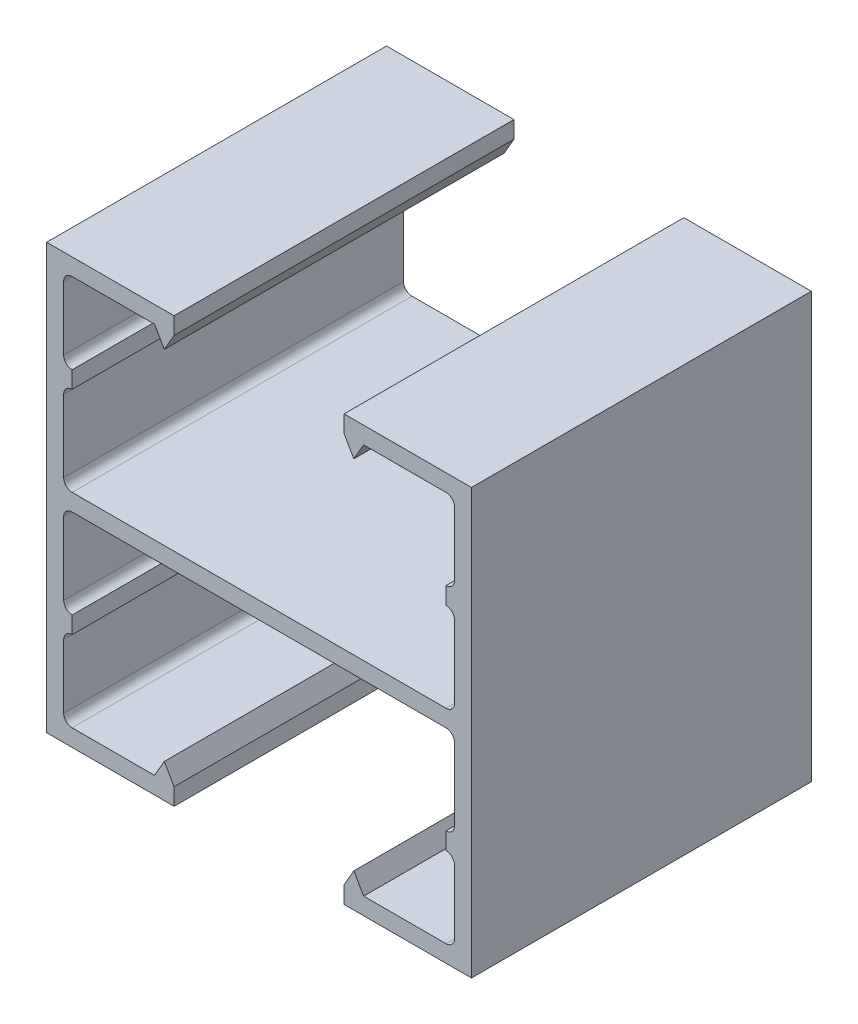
ISO-10303-21;
HEADER;
FILE_DESCRIPTION(('STEP AP214'),'2;1');
FILE_NAME('part.step','',(''),(''),'','','');
FILE_SCHEMA(('AUTOMOTIVE_DESIGN { 1 0 10303 214 1 1 1 1 }'));
ENDSEC;
DATA;
#1=APPLICATION_CONTEXT('core data for automotive mechanical design processes');
#2=APPLICATION_PROTOCOL_DEFINITION('international standard','automotive_design',2000,#1);
#3=PRODUCT_CONTEXT('',#1,'mechanical');
#4=PRODUCT('Part','Part','',(#3));
#5=PRODUCT_RELATED_PRODUCT_CATEGORY('part','',(#4));
#6=PRODUCT_DEFINITION_FORMATION('','',#4);
#7=PRODUCT_DEFINITION_CONTEXT('part definition',#1,'design');
#8=PRODUCT_DEFINITION('design','',#6,#7);
#9=PRODUCT_DEFINITION_SHAPE('','',#8);
#10=(LENGTH_UNIT() NAMED_UNIT(*) SI_UNIT(.MILLI.,.METRE.));
#11=(NAMED_UNIT(*) PLANE_ANGLE_UNIT() SI_UNIT($,.RADIAN.));
#12=(NAMED_UNIT(*) SI_UNIT($,.STERADIAN.) SOLID_ANGLE_UNIT());
#13=UNCERTAINTY_MEASURE_WITH_UNIT(LENGTH_MEASURE(1.E-05),#10,'distance_accuracy_value','');
#14=(GEOMETRIC_REPRESENTATION_CONTEXT(3) GLOBAL_UNCERTAINTY_ASSIGNED_CONTEXT((#13)) GLOBAL_UNIT_ASSIGNED_CONTEXT((#10,
#11,#12)) REPRESENTATION_CONTEXT('',''));
#15=CARTESIAN_POINT('',(0.,0.,0.));
#16=DIRECTION('',(0.,0.,1.));
#17=DIRECTION('',(1.,0.,0.));
#18=AXIS2_PLACEMENT_3D('',#15,#16,#17);
#19=CARTESIAN_POINT('',(-13.97,1.27,12.7));
#20=DIRECTION('',(0.,0.,-1.));
#21=DIRECTION('',(-1.,0.,0.));
#22=AXIS2_PLACEMENT_3D('',#19,#20,#21);
#23=CYLINDRICAL_SURFACE('',#22,0.634999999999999);
#24=CARTESIAN_POINT('',(-13.97,1.27,-12.7));
#25=DIRECTION('',(0.,0.,-1.));
#26=DIRECTION('',(1.,0.,0.));
#27=AXIS2_PLACEMENT_3D('',#24,#25,#26);
#28=CIRCLE('',#27,0.634999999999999);
#29=CARTESIAN_POINT('',(-13.97,0.635,-12.7));
#30=VERTEX_POINT('',#29);
#31=CARTESIAN_POINT('',(-14.605,1.27,-12.7));
#32=VERTEX_POINT('',#31);
#33=EDGE_CURVE('E383',#30,#32,#28,.T.);
#34=ORIENTED_EDGE('',*,*,#33,.T.);
#35=DIRECTION('',(0.,0.,-1.));
#36=VECTOR('',#35,1.);
#37=CARTESIAN_POINT('',(-14.605,1.27,12.7));
#38=LINE('',#37,#36);
#39=CARTESIAN_POINT('',(-14.605,1.27,12.7));
#40=VERTEX_POINT('',#39);
#41=EDGE_CURVE('E365',#40,#32,#38,.T.);
#42=ORIENTED_EDGE('',*,*,#41,.F.);
#43=CARTESIAN_POINT('',(-13.97,1.27,12.7));
#44=DIRECTION('',(0.,0.,-1.));
#45=DIRECTION('',(1.,0.,0.));
#46=AXIS2_PLACEMENT_3D('',#43,#44,#45);
#47=CIRCLE('',#46,0.634999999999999);
#48=CARTESIAN_POINT('',(-13.97,0.635,12.7));
#49=VERTEX_POINT('',#48);
#50=EDGE_CURVE('E371',#49,#40,#47,.T.);
#51=ORIENTED_EDGE('',*,*,#50,.F.);
#52=DIRECTION('',(0.,0.,-1.));
#53=VECTOR('',#52,1.);
#54=CARTESIAN_POINT('',(-13.97,0.635,12.7));
#55=LINE('',#54,#53);
#56=EDGE_CURVE('E621',#49,#30,#55,.T.);
#57=ORIENTED_EDGE('',*,*,#56,.T.);
#58=EDGE_LOOP('',(#34,#42,#51,#57));
#59=FACE_BOUND('',#58,.T.);
#60=ADVANCED_FACE('F33',(#59),#23,.F.);
#61=CARTESIAN_POINT('',(-14.605,7.3025,12.7));
#62=DIRECTION('',(-1.,0.,0.));
#63=DIRECTION('',(0.,-1.,0.));
#64=AXIS2_PLACEMENT_3D('',#61,#62,#63);
#65=PLANE('',#64);
#66=DIRECTION('',(0.,1.,0.));
#67=VECTOR('',#66,1.);
#68=CARTESIAN_POINT('',(-14.605,7.3025,-12.7));
#69=LINE('',#68,#67);
#70=CARTESIAN_POINT('',(-14.605,6.6675,-12.7));
#71=VERTEX_POINT('',#70);
#72=EDGE_CURVE('E535',#32,#71,#69,.T.);
#73=ORIENTED_EDGE('',*,*,#72,.T.);
#74=DIRECTION('',(0.,0.,-1.));
#75=VECTOR('',#74,1.);
#76=CARTESIAN_POINT('',(-14.605,6.6675,12.7));
#77=LINE('',#76,#75);
#78=CARTESIAN_POINT('',(-14.605,6.6675,12.7));
#79=VERTEX_POINT('',#78);
#80=EDGE_CURVE('E368',#71,#79,#77,.F.);
#81=ORIENTED_EDGE('',*,*,#80,.T.);
#82=DIRECTION('',(0.,1.,0.));
#83=VECTOR('',#82,1.);
#84=CARTESIAN_POINT('',(-14.605,7.3025,12.7));
#85=LINE('',#84,#83);
#86=EDGE_CURVE('E360',#40,#79,#85,.T.);
#87=ORIENTED_EDGE('',*,*,#86,.F.);
#88=ORIENTED_EDGE('',*,*,#41,.T.);
#89=EDGE_LOOP('',(#73,#81,#87,#88));
#90=FACE_BOUND('',#89,.T.);
#91=ADVANCED_FACE('F363',(#90),#65,.F.);
#92=CARTESIAN_POINT('',(-13.97,8.5725,12.7));
#93=DIRECTION('',(-1.,0.,0.));
#94=DIRECTION('',(0.,0.,1.));
#95=AXIS2_PLACEMENT_3D('',#92,#93,#94);
#96=PLANE('',#95);
#97=DIRECTION('',(0.,1.,0.));
#98=VECTOR('',#97,1.);
#99=CARTESIAN_POINT('',(-13.97,8.5725,-12.7));
#100=LINE('',#99,#98);
#101=CARTESIAN_POINT('',(-13.97,7.3025,-12.7));
#102=VERTEX_POINT('',#101);
#103=CARTESIAN_POINT('',(-13.97,8.5725,-12.7));
#104=VERTEX_POINT('',#103);
#105=EDGE_CURVE('E533',#102,#104,#100,.T.);
#106=ORIENTED_EDGE('',*,*,#105,.T.);
#107=DIRECTION('',(0.,0.,-1.));
#108=VECTOR('',#107,1.);
#109=CARTESIAN_POINT('',(-13.97,8.5725,12.7));
#110=LINE('',#109,#108);
#111=CARTESIAN_POINT('',(-13.97,8.5725,12.7));
#112=VERTEX_POINT('',#111);
#113=EDGE_CURVE('E390',#112,#104,#110,.T.);
#114=ORIENTED_EDGE('',*,*,#113,.F.);
#115=DIRECTION('',(0.,1.,0.));
#116=VECTOR('',#115,1.);
#117=CARTESIAN_POINT('',(-13.97,8.5725,12.7));
#118=LINE('',#117,#116);
#119=CARTESIAN_POINT('',(-13.97,7.3025,12.7));
#120=VERTEX_POINT('',#119);
#121=EDGE_CURVE('E370',#120,#112,#118,.T.);
#122=ORIENTED_EDGE('',*,*,#121,.F.);
#123=DIRECTION('',(0.,0.,-1.));
#124=VECTOR('',#123,1.);
#125=CARTESIAN_POINT('',(-13.97,7.3025,12.7));
#126=LINE('',#125,#124);
#127=EDGE_CURVE('E385',#120,#102,#126,.T.);
#128=ORIENTED_EDGE('',*,*,#127,.T.);
#129=EDGE_LOOP('',(#106,#114,#122,#128));
#130=FACE_BOUND('',#129,.T.);
#131=ADVANCED_FACE('F530',(#130),#96,.F.);
#132=CARTESIAN_POINT('',(-14.605,13.97,12.7));
#133=DIRECTION('',(-1.,0.,0.));
#134=DIRECTION('',(0.,0.,1.));
#135=AXIS2_PLACEMENT_3D('',#132,#133,#134);
#136=PLANE('',#135);
#137=DIRECTION('',(0.,1.,0.));
#138=VECTOR('',#137,1.);
#139=CARTESIAN_POINT('',(-14.605,13.97,12.7));
#140=LINE('',#139,#138);
#141=CARTESIAN_POINT('',(-14.605,9.2075,12.7));
#142=VERTEX_POINT('',#141);
#143=CARTESIAN_POINT('',(-14.605,13.97,12.7));
#144=VERTEX_POINT('',#143);
#145=EDGE_CURVE('E738',#142,#144,#140,.T.);
#146=ORIENTED_EDGE('',*,*,#145,.F.);
#147=DIRECTION('',(0.,0.,-1.));
#148=VECTOR('',#147,1.);
#149=CARTESIAN_POINT('',(-14.605,9.2075,-12.7));
#150=LINE('',#149,#148);
#151=CARTESIAN_POINT('',(-14.605,9.2075,-12.7));
#152=VERTEX_POINT('',#151);
#153=EDGE_CURVE('E395',#142,#152,#150,.T.);
#154=ORIENTED_EDGE('',*,*,#153,.T.);
#155=DIRECTION('',(0.,1.,0.));
#156=VECTOR('',#155,1.);
#157=CARTESIAN_POINT('',(-14.605,13.97,-12.7));
#158=LINE('',#157,#156);
#159=CARTESIAN_POINT('',(-14.605,13.97,-12.7));
#160=VERTEX_POINT('',#159);
#161=EDGE_CURVE('E534',#152,#160,#158,.T.);
#162=ORIENTED_EDGE('',*,*,#161,.T.);
#163=DIRECTION('',(0.,0.,-1.));
#164=VECTOR('',#163,1.);
#165=CARTESIAN_POINT('',(-14.605,13.97,12.7));
#166=LINE('',#165,#164);
#167=EDGE_CURVE('E519',#144,#160,#166,.T.);
#168=ORIENTED_EDGE('',*,*,#167,.F.);
#169=EDGE_LOOP('',(#146,#154,#162,#168));
#170=FACE_BOUND('',#169,.T.);
#171=ADVANCED_FACE('F1023',(#170),#136,.F.);
#172=CARTESIAN_POINT('',(-13.97,13.97,12.7));
#173=DIRECTION('',(0.,0.,-1.));
#174=DIRECTION('',(-1.,0.,0.));
#175=AXIS2_PLACEMENT_3D('',#172,#173,#174);
#176=CYLINDRICAL_SURFACE('',#175,0.635000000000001);
#177=CARTESIAN_POINT('',(-13.97,13.97,-12.7));
#178=DIRECTION('',(0.,0.,-1.));
#179=DIRECTION('',(1.,0.,0.));
#180=AXIS2_PLACEMENT_3D('',#177,#178,#179);
#181=CIRCLE('',#180,0.635000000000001);
#182=CARTESIAN_POINT('',(-13.97,14.605,-12.7));
#183=VERTEX_POINT('',#182);
#184=EDGE_CURVE('E537',#160,#183,#181,.T.);
#185=ORIENTED_EDGE('',*,*,#184,.T.);
#186=DIRECTION('',(0.,0.,-1.));
#187=VECTOR('',#186,1.);
#188=CARTESIAN_POINT('',(-13.97,14.605,12.7));
#189=LINE('',#188,#187);
#190=CARTESIAN_POINT('',(-13.97,14.605,12.7));
#191=VERTEX_POINT('',#190);
#192=EDGE_CURVE('E516',#191,#183,#189,.T.);
#193=ORIENTED_EDGE('',*,*,#192,.F.);
#194=CARTESIAN_POINT('',(-13.97,13.97,12.7));
#195=DIRECTION('',(0.,0.,-1.));
#196=DIRECTION('',(1.,0.,0.));
#197=AXIS2_PLACEMENT_3D('',#194,#195,#196);
#198=CIRCLE('',#197,0.635000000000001);
#199=EDGE_CURVE('E740',#144,#191,#198,.T.);
#200=ORIENTED_EDGE('',*,*,#199,.F.);
#201=ORIENTED_EDGE('',*,*,#167,.T.);
#202=EDGE_LOOP('',(#185,#193,#200,#201));
#203=FACE_BOUND('',#202,.T.);
#204=ADVANCED_FACE('F1031',(#203),#176,.F.);
#205=CARTESIAN_POINT('',(-7.81646968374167,14.605,12.7));
#206=DIRECTION('',(0.,1.,0.));
#207=DIRECTION('',(-1.,0.,0.));
#208=AXIS2_PLACEMENT_3D('',#205,#206,#207);
#209=PLANE('',#208);
#210=DIRECTION('',(1.,0.,0.));
#211=VECTOR('',#210,1.);
#212=CARTESIAN_POINT('',(-7.81646968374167,14.605,-12.7));
#213=LINE('',#212,#211);
#214=CARTESIAN_POINT('',(-7.81646968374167,14.605,-12.7));
#215=VERTEX_POINT('',#214);
#216=EDGE_CURVE('E543',#183,#215,#213,.T.);
#217=ORIENTED_EDGE('',*,*,#216,.T.);
#218=DIRECTION('',(0.,0.,-1.));
#219=VECTOR('',#218,1.);
#220=CARTESIAN_POINT('',(-7.81646968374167,14.605,12.7));
#221=LINE('',#220,#219);
#222=CARTESIAN_POINT('',(-7.81646968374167,14.605,12.7));
#223=VERTEX_POINT('',#222);
#224=EDGE_CURVE('E513',#223,#215,#221,.T.);
#225=ORIENTED_EDGE('',*,*,#224,.F.);
#226=DIRECTION('',(1.,0.,0.));
#227=VECTOR('',#226,1.);
#228=CARTESIAN_POINT('',(-7.81646968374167,14.605,12.7));
#229=LINE('',#228,#227);
#230=EDGE_CURVE('E744',#191,#223,#229,.T.);
#231=ORIENTED_EDGE('',*,*,#230,.F.);
#232=ORIENTED_EDGE('',*,*,#192,.T.);
#233=EDGE_LOOP('',(#217,#225,#231,#232));
#234=FACE_BOUND('',#233,.T.);
#235=ADVANCED_FACE('F1311',(#234),#209,.F.);
#236=CARTESIAN_POINT('',(-7.81646968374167,14.605,12.7));
#237=DIRECTION('',(0.866025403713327,0.500000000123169,0.));
#238=DIRECTION('',(-0.500000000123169,0.866025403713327,0.));
#239=AXIS2_PLACEMENT_3D('',#236,#237,#238);
#240=PLANE('',#239);
#241=DIRECTION('',(0.500000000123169,-0.866025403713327,0.));
#242=VECTOR('',#241,1.);
#243=CARTESIAN_POINT('',(-7.81646968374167,14.605,-12.7));
#244=LINE('',#243,#242);
#245=CARTESIAN_POINT('',(-7.08323484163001,13.335,-12.7));
#246=VERTEX_POINT('',#245);
#247=EDGE_CURVE('E545',#215,#246,#244,.T.);
#248=ORIENTED_EDGE('',*,*,#247,.T.);
#249=DIRECTION('',(0.,0.,-1.));
#250=VECTOR('',#249,1.);
#251=CARTESIAN_POINT('',(-7.08323484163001,13.335,12.7));
#252=LINE('',#251,#250);
#253=CARTESIAN_POINT('',(-7.08323484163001,13.335,12.7));
#254=VERTEX_POINT('',#253);
#255=EDGE_CURVE('E510',#254,#246,#252,.T.);
#256=ORIENTED_EDGE('',*,*,#255,.F.);
#257=DIRECTION('',(0.500000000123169,-0.866025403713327,0.));
#258=VECTOR('',#257,1.);
#259=CARTESIAN_POINT('',(-7.81646968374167,14.605,12.7));
#260=LINE('',#259,#258);
#261=EDGE_CURVE('E746',#223,#254,#260,.T.);
#262=ORIENTED_EDGE('',*,*,#261,.F.);
#263=ORIENTED_EDGE('',*,*,#224,.T.);
#264=EDGE_LOOP('',(#248,#256,#262,#263));
#265=FACE_BOUND('',#264,.T.);
#266=ADVANCED_FACE('F1301',(#265),#240,.F.);
#267=CARTESIAN_POINT('',(-7.08323484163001,13.335,12.7));
#268=DIRECTION('',(-0.866025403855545,0.49999999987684,0.));
#269=DIRECTION('',(-0.49999999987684,-0.866025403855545,0.));
#270=AXIS2_PLACEMENT_3D('',#267,#268,#269);
#271=PLANE('',#270);
#272=DIRECTION('',(0.49999999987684,0.866025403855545,0.));
#273=VECTOR('',#272,1.);
#274=CARTESIAN_POINT('',(-7.08323484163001,13.335,-12.7));
#275=LINE('',#274,#273);
#276=CARTESIAN_POINT('',(-6.35,14.605,-12.7));
#277=VERTEX_POINT('',#276);
#278=EDGE_CURVE('E547',#246,#277,#275,.T.);
#279=ORIENTED_EDGE('',*,*,#278,.T.);
#280=DIRECTION('',(0.,0.,-1.));
#281=VECTOR('',#280,1.);
#282=CARTESIAN_POINT('',(-6.35,14.605,12.7));
#283=LINE('',#282,#281);
#284=CARTESIAN_POINT('',(-6.35,14.605,12.7));
#285=VERTEX_POINT('',#284);
#286=EDGE_CURVE('E507',#285,#277,#283,.T.);
#287=ORIENTED_EDGE('',*,*,#286,.F.);
#288=DIRECTION('',(0.49999999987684,0.866025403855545,0.));
#289=VECTOR('',#288,1.);
#290=CARTESIAN_POINT('',(-7.08323484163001,13.335,12.7));
#291=LINE('',#290,#289);
#292=EDGE_CURVE('E748',#254,#285,#291,.T.);
#293=ORIENTED_EDGE('',*,*,#292,.F.);
#294=ORIENTED_EDGE('',*,*,#255,.T.);
#295=EDGE_LOOP('',(#279,#287,#293,#294));
#296=FACE_BOUND('',#295,.T.);
#297=ADVANCED_FACE('F1291',(#296),#271,.F.);
#298=CARTESIAN_POINT('',(-6.35,14.605,12.7));
#299=DIRECTION('',(-1.,0.,0.));
#300=DIRECTION('',(0.,-1.,0.));
#301=AXIS2_PLACEMENT_3D('',#298,#299,#300);
#302=PLANE('',#301);
#303=DIRECTION('',(0.,1.,0.));
#304=VECTOR('',#303,1.);
#305=CARTESIAN_POINT('',(-6.35,14.605,-12.7));
#306=LINE('',#305,#304);
#307=CARTESIAN_POINT('',(-6.35,15.875,-12.7));
#308=VERTEX_POINT('',#307);
#309=EDGE_CURVE('E549',#277,#308,#306,.T.);
#310=ORIENTED_EDGE('',*,*,#309,.T.);
#311=DIRECTION('',(0.,0.,-1.));
#312=VECTOR('',#311,1.);
#313=CARTESIAN_POINT('',(-6.35,15.875,12.7));
#314=LINE('',#313,#312);
#315=CARTESIAN_POINT('',(-6.35,15.875,12.7));
#316=VERTEX_POINT('',#315);
#317=EDGE_CURVE('E504',#316,#308,#314,.T.);
#318=ORIENTED_EDGE('',*,*,#317,.F.);
#319=DIRECTION('',(0.,1.,0.));
#320=VECTOR('',#319,1.);
#321=CARTESIAN_POINT('',(-6.35,14.605,12.7));
#322=LINE('',#321,#320);
#323=EDGE_CURVE('E750',#285,#316,#322,.T.);
#324=ORIENTED_EDGE('',*,*,#323,.F.);
#325=ORIENTED_EDGE('',*,*,#286,.T.);
#326=EDGE_LOOP('',(#310,#318,#324,#325));
#327=FACE_BOUND('',#326,.T.);
#328=ADVANCED_FACE('F1281',(#327),#302,.F.);
#329=CARTESIAN_POINT('',(-6.35,15.875,12.7));
#330=DIRECTION('',(0.,-1.,0.));
#331=DIRECTION('',(0.,0.,-1.));
#332=AXIS2_PLACEMENT_3D('',#329,#330,#331);
#333=PLANE('',#332);
#334=DIRECTION('',(-1.,0.,0.));
#335=VECTOR('',#334,1.);
#336=CARTESIAN_POINT('',(-6.35,15.875,-12.7));
#337=LINE('',#336,#335);
#338=CARTESIAN_POINT('',(-15.875,15.875,-12.7));
#339=VERTEX_POINT('',#338);
#340=EDGE_CURVE('E551',#308,#339,#337,.T.);
#341=ORIENTED_EDGE('',*,*,#340,.T.);
#342=DIRECTION('',(0.,0.,-1.));
#343=VECTOR('',#342,1.);
#344=CARTESIAN_POINT('',(-15.875,15.875,12.7));
#345=LINE('',#344,#343);
#346=CARTESIAN_POINT('',(-15.875,15.875,12.7));
#347=VERTEX_POINT('',#346);
#348=EDGE_CURVE('E501',#347,#339,#345,.T.);
#349=ORIENTED_EDGE('',*,*,#348,.F.);
#350=DIRECTION('',(-1.,0.,0.));
#351=VECTOR('',#350,1.);
#352=CARTESIAN_POINT('',(-6.35,15.875,12.7));
#353=LINE('',#352,#351);
#354=EDGE_CURVE('E752',#316,#347,#353,.T.);
#355=ORIENTED_EDGE('',*,*,#354,.F.);
#356=ORIENTED_EDGE('',*,*,#317,.T.);
#357=EDGE_LOOP('',(#341,#349,#355,#356));
#358=FACE_BOUND('',#357,.T.);
#359=ADVANCED_FACE('F1271',(#358),#333,.F.);
#360=CARTESIAN_POINT('',(-15.875,15.875,12.7));
#361=DIRECTION('',(1.,0.,0.));
#362=DIRECTION('',(0.,1.,0.));
#363=AXIS2_PLACEMENT_3D('',#360,#361,#362);
#364=PLANE('',#363);
#365=DIRECTION('',(0.,-1.,0.));
#366=VECTOR('',#365,1.);
#367=CARTESIAN_POINT('',(-15.875,15.875,-12.7));
#368=LINE('',#367,#366);
#369=CARTESIAN_POINT('',(-15.875,-15.875,-12.7));
#370=VERTEX_POINT('',#369);
#371=EDGE_CURVE('E553',#339,#370,#368,.T.);
#372=ORIENTED_EDGE('',*,*,#371,.T.);
#373=DIRECTION('',(0.,0.,-1.));
#374=VECTOR('',#373,1.);
#375=CARTESIAN_POINT('',(-15.875,-15.875,12.7));
#376=LINE('',#375,#374);
#377=CARTESIAN_POINT('',(-15.875,-15.875,12.7));
#378=VERTEX_POINT('',#377);
#379=EDGE_CURVE('E498',#378,#370,#376,.T.);
#380=ORIENTED_EDGE('',*,*,#379,.F.);
#381=DIRECTION('',(0.,-1.,0.));
#382=VECTOR('',#381,1.);
#383=CARTESIAN_POINT('',(-15.875,15.875,12.7));
#384=LINE('',#383,#382);
#385=EDGE_CURVE('E754',#347,#378,#384,.T.);
#386=ORIENTED_EDGE('',*,*,#385,.F.);
#387=ORIENTED_EDGE('',*,*,#348,.T.);
#388=EDGE_LOOP('',(#372,#380,#386,#387));
#389=FACE_BOUND('',#388,.T.);
#390=ADVANCED_FACE('F1261',(#389),#364,.F.);
#391=CARTESIAN_POINT('',(-6.35,-15.875,12.7));
#392=DIRECTION('',(0.,1.,0.));
#393=DIRECTION('',(0.,0.,1.));
#394=AXIS2_PLACEMENT_3D('',#391,#392,#393);
#395=PLANE('',#394);
#396=DIRECTION('',(1.,0.,0.));
#397=VECTOR('',#396,1.);
#398=CARTESIAN_POINT('',(-6.35,-15.875,-12.7));
#399=LINE('',#398,#397);
#400=CARTESIAN_POINT('',(-6.35,-15.875,-12.7));
#401=VERTEX_POINT('',#400);
#402=EDGE_CURVE('E555',#370,#401,#399,.T.);
#403=ORIENTED_EDGE('',*,*,#402,.T.);
#404=DIRECTION('',(0.,0.,-1.));
#405=VECTOR('',#404,1.);
#406=CARTESIAN_POINT('',(-6.35,-15.875,12.7));
#407=LINE('',#406,#405);
#408=CARTESIAN_POINT('',(-6.35,-15.875,12.7));
#409=VERTEX_POINT('',#408);
#410=EDGE_CURVE('E495',#409,#401,#407,.T.);
#411=ORIENTED_EDGE('',*,*,#410,.F.);
#412=DIRECTION('',(1.,0.,0.));
#413=VECTOR('',#412,1.);
#414=CARTESIAN_POINT('',(-6.35,-15.875,12.7));
#415=LINE('',#414,#413);
#416=EDGE_CURVE('E756',#378,#409,#415,.T.);
#417=ORIENTED_EDGE('',*,*,#416,.F.);
#418=ORIENTED_EDGE('',*,*,#379,.T.);
#419=EDGE_LOOP('',(#403,#411,#417,#418));
#420=FACE_BOUND('',#419,.T.);
#421=ADVANCED_FACE('F1251',(#420),#395,.F.);
#422=CARTESIAN_POINT('',(-6.35,-14.605,12.7));
#423=DIRECTION('',(-1.,0.,0.));
#424=DIRECTION('',(0.,-1.,0.));
#425=AXIS2_PLACEMENT_3D('',#422,#423,#424);
#426=PLANE('',#425);
#427=DIRECTION('',(0.,1.,0.));
#428=VECTOR('',#427,1.);
#429=CARTESIAN_POINT('',(-6.35,-14.605,-12.7));
#430=LINE('',#429,#428);
#431=CARTESIAN_POINT('',(-6.35,-14.605,-12.7));
#432=VERTEX_POINT('',#431);
#433=EDGE_CURVE('E557',#401,#432,#430,.T.);
#434=ORIENTED_EDGE('',*,*,#433,.T.);
#435=DIRECTION('',(0.,0.,-1.));
#436=VECTOR('',#435,1.);
#437=CARTESIAN_POINT('',(-6.35,-14.605,12.7));
#438=LINE('',#437,#436);
#439=CARTESIAN_POINT('',(-6.35,-14.605,12.7));
#440=VERTEX_POINT('',#439);
#441=EDGE_CURVE('E492',#440,#432,#438,.T.);
#442=ORIENTED_EDGE('',*,*,#441,.F.);
#443=DIRECTION('',(0.,1.,0.));
#444=VECTOR('',#443,1.);
#445=CARTESIAN_POINT('',(-6.35,-14.605,12.7));
#446=LINE('',#445,#444);
#447=EDGE_CURVE('E758',#409,#440,#446,.T.);
#448=ORIENTED_EDGE('',*,*,#447,.F.);
#449=ORIENTED_EDGE('',*,*,#410,.T.);
#450=EDGE_LOOP('',(#434,#442,#448,#449));
#451=FACE_BOUND('',#450,.T.);
#452=ADVANCED_FACE('F1241',(#451),#426,.F.);
#453=CARTESIAN_POINT('',(-7.08323484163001,-13.335,12.7));
#454=DIRECTION('',(-0.866025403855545,-0.49999999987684,0.));
#455=DIRECTION('',(0.49999999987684,-0.866025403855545,0.));
#456=AXIS2_PLACEMENT_3D('',#453,#454,#455);
#457=PLANE('',#456);
#458=DIRECTION('',(-0.49999999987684,0.866025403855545,0.));
#459=VECTOR('',#458,1.);
#460=CARTESIAN_POINT('',(-7.08323484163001,-13.335,-12.7));
#461=LINE('',#460,#459);
#462=CARTESIAN_POINT('',(-7.08323484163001,-13.335,-12.7));
#463=VERTEX_POINT('',#462);
#464=EDGE_CURVE('E559',#432,#463,#461,.T.);
#465=ORIENTED_EDGE('',*,*,#464,.T.);
#466=DIRECTION('',(0.,0.,-1.));
#467=VECTOR('',#466,1.);
#468=CARTESIAN_POINT('',(-7.08323484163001,-13.335,12.7));
#469=LINE('',#468,#467);
#470=CARTESIAN_POINT('',(-7.08323484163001,-13.335,12.7));
#471=VERTEX_POINT('',#470);
#472=EDGE_CURVE('E489',#471,#463,#469,.T.);
#473=ORIENTED_EDGE('',*,*,#472,.F.);
#474=DIRECTION('',(-0.49999999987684,0.866025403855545,0.));
#475=VECTOR('',#474,1.);
#476=CARTESIAN_POINT('',(-7.08323484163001,-13.335,12.7));
#477=LINE('',#476,#475);
#478=EDGE_CURVE('E760',#440,#471,#477,.T.);
#479=ORIENTED_EDGE('',*,*,#478,.F.);
#480=ORIENTED_EDGE('',*,*,#441,.T.);
#481=EDGE_LOOP('',(#465,#473,#479,#480));
#482=FACE_BOUND('',#481,.T.);
#483=ADVANCED_FACE('F1231',(#482),#457,.F.);
#484=CARTESIAN_POINT('',(-7.81646968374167,-14.605,12.7));
#485=DIRECTION('',(0.866025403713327,-0.500000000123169,0.));
#486=DIRECTION('',(0.500000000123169,0.866025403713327,0.));
#487=AXIS2_PLACEMENT_3D('',#484,#485,#486);
#488=PLANE('',#487);
#489=DIRECTION('',(-0.500000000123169,-0.866025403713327,0.));
#490=VECTOR('',#489,1.);
#491=CARTESIAN_POINT('',(-7.81646968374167,-14.605,-12.7));
#492=LINE('',#491,#490);
#493=CARTESIAN_POINT('',(-7.81646968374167,-14.605,-12.7));
#494=VERTEX_POINT('',#493);
#495=EDGE_CURVE('E561',#463,#494,#492,.T.);
#496=ORIENTED_EDGE('',*,*,#495,.T.);
#497=DIRECTION('',(0.,0.,-1.));
#498=VECTOR('',#497,1.);
#499=CARTESIAN_POINT('',(-7.81646968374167,-14.605,12.7));
#500=LINE('',#499,#498);
#501=CARTESIAN_POINT('',(-7.81646968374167,-14.605,12.7));
#502=VERTEX_POINT('',#501);
#503=EDGE_CURVE('E486',#502,#494,#500,.T.);
#504=ORIENTED_EDGE('',*,*,#503,.F.);
#505=DIRECTION('',(-0.500000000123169,-0.866025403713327,0.));
#506=VECTOR('',#505,1.);
#507=CARTESIAN_POINT('',(-7.81646968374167,-14.605,12.7));
#508=LINE('',#507,#506);
#509=EDGE_CURVE('E762',#471,#502,#508,.T.);
#510=ORIENTED_EDGE('',*,*,#509,.F.);
#511=ORIENTED_EDGE('',*,*,#472,.T.);
#512=EDGE_LOOP('',(#496,#504,#510,#511));
#513=FACE_BOUND('',#512,.T.);
#514=ADVANCED_FACE('F1221',(#513),#488,.F.);
#515=CARTESIAN_POINT('',(-7.81646968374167,-14.605,12.7));
#516=DIRECTION('',(0.,-1.,0.));
#517=DIRECTION('',(1.,0.,0.));
#518=AXIS2_PLACEMENT_3D('',#515,#516,#517);
#519=PLANE('',#518);
#520=DIRECTION('',(-1.,0.,0.));
#521=VECTOR('',#520,1.);
#522=CARTESIAN_POINT('',(-7.81646968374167,-14.605,-12.7));
#523=LINE('',#522,#521);
#524=CARTESIAN_POINT('',(-13.97,-14.605,-12.7));
#525=VERTEX_POINT('',#524);
#526=EDGE_CURVE('E563',#494,#525,#523,.T.);
#527=ORIENTED_EDGE('',*,*,#526,.T.);
#528=DIRECTION('',(0.,0.,-1.));
#529=VECTOR('',#528,1.);
#530=CARTESIAN_POINT('',(-13.97,-14.605,12.7));
#531=LINE('',#530,#529);
#532=CARTESIAN_POINT('',(-13.97,-14.605,12.7));
#533=VERTEX_POINT('',#532);
#534=EDGE_CURVE('E483',#533,#525,#531,.T.);
#535=ORIENTED_EDGE('',*,*,#534,.F.);
#536=DIRECTION('',(-1.,0.,0.));
#537=VECTOR('',#536,1.);
#538=CARTESIAN_POINT('',(-7.81646968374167,-14.605,12.7));
#539=LINE('',#538,#537);
#540=EDGE_CURVE('E764',#502,#533,#539,.T.);
#541=ORIENTED_EDGE('',*,*,#540,.F.);
#542=ORIENTED_EDGE('',*,*,#503,.T.);
#543=EDGE_LOOP('',(#527,#535,#541,#542));
#544=FACE_BOUND('',#543,.T.);
#545=ADVANCED_FACE('F1211',(#544),#519,.F.);
#546=CARTESIAN_POINT('',(-13.97,-13.97,12.7));
#547=DIRECTION('',(0.,0.,-1.));
#548=DIRECTION('',(-1.,0.,0.));
#549=AXIS2_PLACEMENT_3D('',#546,#547,#548);
#550=CYLINDRICAL_SURFACE('',#549,0.635000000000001);
#551=CARTESIAN_POINT('',(-13.97,-13.97,-12.7));
#552=DIRECTION('',(0.,0.,-1.));
#553=DIRECTION('',(-1.,0.,0.));
#554=AXIS2_PLACEMENT_3D('',#551,#552,#553);
#555=CIRCLE('',#554,0.635000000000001);
#556=CARTESIAN_POINT('',(-14.605,-13.97,-12.7));
#557=VERTEX_POINT('',#556);
#558=EDGE_CURVE('E565',#525,#557,#555,.T.);
#559=ORIENTED_EDGE('',*,*,#558,.T.);
#560=DIRECTION('',(0.,0.,-1.));
#561=VECTOR('',#560,1.);
#562=CARTESIAN_POINT('',(-14.605,-13.97,12.7));
#563=LINE('',#562,#561);
#564=CARTESIAN_POINT('',(-14.605,-13.97,12.7));
#565=VERTEX_POINT('',#564);
#566=EDGE_CURVE('E480',#565,#557,#563,.T.);
#567=ORIENTED_EDGE('',*,*,#566,.F.);
#568=CARTESIAN_POINT('',(-13.97,-13.97,12.7));
#569=DIRECTION('',(0.,0.,-1.));
#570=DIRECTION('',(-1.,0.,0.));
#571=AXIS2_PLACEMENT_3D('',#568,#569,#570);
#572=CIRCLE('',#571,0.635000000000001);
#573=EDGE_CURVE('E766',#533,#565,#572,.T.);
#574=ORIENTED_EDGE('',*,*,#573,.F.);
#575=ORIENTED_EDGE('',*,*,#534,.T.);
#576=EDGE_LOOP('',(#559,#567,#574,#575));
#577=FACE_BOUND('',#576,.T.);
#578=ADVANCED_FACE('F1045',(#577),#550,.F.);
#579=CARTESIAN_POINT('',(-14.605,-13.97,12.7));
#580=DIRECTION('',(-1.,0.,0.));
#581=DIRECTION('',(0.,-1.,0.));
#582=AXIS2_PLACEMENT_3D('',#579,#580,#581);
#583=PLANE('',#582);
#584=DIRECTION('',(0.,1.,0.));
#585=VECTOR('',#584,1.);
#586=CARTESIAN_POINT('',(-14.605,-13.97,-12.7));
#587=LINE('',#586,#585);
#588=CARTESIAN_POINT('',(-14.605,-9.2075,-12.7));
#589=VERTEX_POINT('',#588);
#590=EDGE_CURVE('E567',#557,#589,#587,.T.);
#591=ORIENTED_EDGE('',*,*,#590,.T.);
#592=DIRECTION('',(0.,0.,-1.));
#593=VECTOR('',#592,1.);
#594=CARTESIAN_POINT('',(-14.605,-9.2075,12.7));
#595=LINE('',#594,#593);
#596=CARTESIAN_POINT('',(-14.605,-9.2075,12.7));
#597=VERTEX_POINT('',#596);
#598=EDGE_CURVE('E402',#589,#597,#595,.F.);
#599=ORIENTED_EDGE('',*,*,#598,.T.);
#600=DIRECTION('',(0.,1.,0.));
#601=VECTOR('',#600,1.);
#602=CARTESIAN_POINT('',(-14.605,-13.97,12.7));
#603=LINE('',#602,#601);
#604=EDGE_CURVE('E768',#565,#597,#603,.T.);
#605=ORIENTED_EDGE('',*,*,#604,.F.);
#606=ORIENTED_EDGE('',*,*,#566,.T.);
#607=EDGE_LOOP('',(#591,#599,#605,#606));
#608=FACE_BOUND('',#607,.T.);
#609=ADVANCED_FACE('F1039',(#608),#583,.F.);
#610=CARTESIAN_POINT('',(-13.97,-8.5725,12.7));
#611=DIRECTION('',(-1.,0.,0.));
#612=DIRECTION('',(0.,0.,1.));
#613=AXIS2_PLACEMENT_3D('',#610,#611,#612);
#614=PLANE('',#613);
#615=DIRECTION('',(0.,1.,0.));
#616=VECTOR('',#615,1.);
#617=CARTESIAN_POINT('',(-13.97,-8.5725,-12.7));
#618=LINE('',#617,#616);
#619=CARTESIAN_POINT('',(-13.97,-8.5725,-12.7));
#620=VERTEX_POINT('',#619);
#621=CARTESIAN_POINT('',(-13.97,-7.3025,-12.7));
#622=VERTEX_POINT('',#621);
#623=EDGE_CURVE('E570',#620,#622,#618,.T.);
#624=ORIENTED_EDGE('',*,*,#623,.T.);
#625=DIRECTION('',(0.,0.,-1.));
#626=VECTOR('',#625,1.);
#627=CARTESIAN_POINT('',(-13.97,-7.3025,12.7));
#628=LINE('',#627,#626);
#629=CARTESIAN_POINT('',(-13.97,-7.3025,12.7));
#630=VERTEX_POINT('',#629);
#631=EDGE_CURVE('E474',#630,#622,#628,.T.);
#632=ORIENTED_EDGE('',*,*,#631,.F.);
#633=DIRECTION('',(0.,1.,0.));
#634=VECTOR('',#633,1.);
#635=CARTESIAN_POINT('',(-13.97,-8.5725,12.7));
#636=LINE('',#635,#634);
#637=CARTESIAN_POINT('',(-13.97,-8.5725,12.7));
#638=VERTEX_POINT('',#637);
#639=EDGE_CURVE('E771',#638,#630,#636,.T.);
#640=ORIENTED_EDGE('',*,*,#639,.F.);
#641=DIRECTION('',(0.,0.,-1.));
#642=VECTOR('',#641,1.);
#643=CARTESIAN_POINT('',(-13.97,-8.5725,12.7));
#644=LINE('',#643,#642);
#645=EDGE_CURVE('E477',#638,#620,#644,.T.);
#646=ORIENTED_EDGE('',*,*,#645,.T.);
#647=EDGE_LOOP('',(#624,#632,#640,#646));
#648=FACE_BOUND('',#647,.T.);
#649=ADVANCED_FACE('F1044',(#648),#614,.F.);
#650=CARTESIAN_POINT('',(-14.605,-7.3025,12.7));
#651=DIRECTION('',(-1.,0.,0.));
#652=DIRECTION('',(0.,0.,1.));
#653=AXIS2_PLACEMENT_3D('',#650,#651,#652);
#654=PLANE('',#653);
#655=DIRECTION('',(0.,1.,0.));
#656=VECTOR('',#655,1.);
#657=CARTESIAN_POINT('',(-14.605,-7.3025,12.7));
#658=LINE('',#657,#656);
#659=CARTESIAN_POINT('',(-14.605,-6.6675,12.7));
#660=VERTEX_POINT('',#659);
#661=CARTESIAN_POINT('',(-14.605,-1.27,12.7));
#662=VERTEX_POINT('',#661);
#663=EDGE_CURVE('E773',#660,#662,#658,.T.);
#664=ORIENTED_EDGE('',*,*,#663,.F.);
#665=DIRECTION('',(0.,0.,-1.));
#666=VECTOR('',#665,1.);
#667=CARTESIAN_POINT('',(-14.605,-6.6675,-12.7));
#668=LINE('',#667,#666);
#669=CARTESIAN_POINT('',(-14.605,-6.6675,-12.7));
#670=VERTEX_POINT('',#669);
#671=EDGE_CURVE('E398',#660,#670,#668,.T.);
#672=ORIENTED_EDGE('',*,*,#671,.T.);
#673=DIRECTION('',(0.,1.,0.));
#674=VECTOR('',#673,1.);
#675=CARTESIAN_POINT('',(-14.605,-7.3025,-12.7));
#676=LINE('',#675,#674);
#677=CARTESIAN_POINT('',(-14.605,-1.27,-12.7));
#678=VERTEX_POINT('',#677);
#679=EDGE_CURVE('E573',#670,#678,#676,.T.);
#680=ORIENTED_EDGE('',*,*,#679,.T.);
#681=DIRECTION('',(0.,0.,-1.));
#682=VECTOR('',#681,1.);
#683=CARTESIAN_POINT('',(-14.605,-1.27,12.7));
#684=LINE('',#683,#682);
#685=EDGE_CURVE('E471',#662,#678,#684,.T.);
#686=ORIENTED_EDGE('',*,*,#685,.F.);
#687=EDGE_LOOP('',(#664,#672,#680,#686));
#688=FACE_BOUND('',#687,.T.);
#689=ADVANCED_FACE('F1057',(#688),#654,.F.);
#690=CARTESIAN_POINT('',(-13.97,-1.27,12.7));
#691=DIRECTION('',(0.,0.,-1.));
#692=DIRECTION('',(-1.,0.,0.));
#693=AXIS2_PLACEMENT_3D('',#690,#691,#692);
#694=CYLINDRICAL_SURFACE('',#693,0.634999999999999);
#695=CARTESIAN_POINT('',(-13.97,-1.27,-12.7));
#696=DIRECTION('',(0.,0.,-1.));
#697=DIRECTION('',(-1.,0.,0.));
#698=AXIS2_PLACEMENT_3D('',#695,#696,#697);
#699=CIRCLE('',#698,0.634999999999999);
#700=CARTESIAN_POINT('',(-13.97,-0.635000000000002,-12.7));
#701=VERTEX_POINT('',#700);
#702=EDGE_CURVE('E575',#678,#701,#699,.T.);
#703=ORIENTED_EDGE('',*,*,#702,.T.);
#704=DIRECTION('',(0.,0.,-1.));
#705=VECTOR('',#704,1.);
#706=CARTESIAN_POINT('',(-13.97,-0.635000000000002,12.7));
#707=LINE('',#706,#705);
#708=CARTESIAN_POINT('',(-13.97,-0.635000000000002,12.7));
#709=VERTEX_POINT('',#708);
#710=EDGE_CURVE('E468',#709,#701,#707,.T.);
#711=ORIENTED_EDGE('',*,*,#710,.F.);
#712=CARTESIAN_POINT('',(-13.97,-1.27,12.7));
#713=DIRECTION('',(0.,0.,-1.));
#714=DIRECTION('',(-1.,0.,0.));
#715=AXIS2_PLACEMENT_3D('',#712,#713,#714);
#716=CIRCLE('',#715,0.634999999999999);
#717=EDGE_CURVE('E775',#662,#709,#716,.T.);
#718=ORIENTED_EDGE('',*,*,#717,.F.);
#719=ORIENTED_EDGE('',*,*,#685,.T.);
#720=EDGE_LOOP('',(#703,#711,#718,#719));
#721=FACE_BOUND('',#720,.T.);
#722=ADVANCED_FACE('F1067',(#721),#694,.F.);
#723=CARTESIAN_POINT('',(-13.97,-0.635000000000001,12.7));
#724=DIRECTION('',(0.,1.,0.));
#725=DIRECTION('',(-1.,0.,0.));
#726=AXIS2_PLACEMENT_3D('',#723,#724,#725);
#727=PLANE('',#726);
#728=DIRECTION('',(1.,0.,0.));
#729=VECTOR('',#728,1.);
#730=CARTESIAN_POINT('',(-13.97,-0.635000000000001,-12.7));
#731=LINE('',#730,#729);
#732=CARTESIAN_POINT('',(13.97,-0.635000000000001,-12.7));
#733=VERTEX_POINT('',#732);
#734=EDGE_CURVE('E577',#701,#733,#731,.T.);
#735=ORIENTED_EDGE('',*,*,#734,.T.);
#736=DIRECTION('',(0.,0.,-1.));
#737=VECTOR('',#736,1.);
#738=CARTESIAN_POINT('',(13.97,-0.635000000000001,12.7));
#739=LINE('',#738,#737);
#740=CARTESIAN_POINT('',(13.97,-0.635000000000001,12.7));
#741=VERTEX_POINT('',#740);
#742=EDGE_CURVE('E465',#741,#733,#739,.T.);
#743=ORIENTED_EDGE('',*,*,#742,.F.);
#744=DIRECTION('',(1.,0.,0.));
#745=VECTOR('',#744,1.);
#746=CARTESIAN_POINT('',(-13.97,-0.635000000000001,12.7));
#747=LINE('',#746,#745);
#748=EDGE_CURVE('E777',#709,#741,#747,.T.);
#749=ORIENTED_EDGE('',*,*,#748,.F.);
#750=ORIENTED_EDGE('',*,*,#710,.T.);
#751=EDGE_LOOP('',(#735,#743,#749,#750));
#752=FACE_BOUND('',#751,.T.);
#753=ADVANCED_FACE('F1187',(#752),#727,.F.);
#754=CARTESIAN_POINT('',(13.97,-1.27,12.7));
#755=DIRECTION('',(0.,0.,-1.));
#756=DIRECTION('',(-1.,0.,0.));
#757=AXIS2_PLACEMENT_3D('',#754,#755,#756);
#758=CYLINDRICAL_SURFACE('',#757,0.635000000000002);
#759=CARTESIAN_POINT('',(13.97,-1.27,-12.7));
#760=DIRECTION('',(0.,0.,-1.));
#761=DIRECTION('',(-1.,0.,0.));
#762=AXIS2_PLACEMENT_3D('',#759,#760,#761);
#763=CIRCLE('',#762,0.635000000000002);
#764=CARTESIAN_POINT('',(14.605,-1.27,-12.7));
#765=VERTEX_POINT('',#764);
#766=EDGE_CURVE('E579',#733,#765,#763,.T.);
#767=ORIENTED_EDGE('',*,*,#766,.T.);
#768=DIRECTION('',(0.,0.,-1.));
#769=VECTOR('',#768,1.);
#770=CARTESIAN_POINT('',(14.605,-1.27,12.7));
#771=LINE('',#770,#769);
#772=CARTESIAN_POINT('',(14.605,-1.27,12.7));
#773=VERTEX_POINT('',#772);
#774=EDGE_CURVE('E456',#773,#765,#771,.T.);
#775=ORIENTED_EDGE('',*,*,#774,.F.);
#776=CARTESIAN_POINT('',(13.97,-1.27,12.7));
#777=DIRECTION('',(0.,0.,-1.));
#778=DIRECTION('',(-1.,0.,0.));
#779=AXIS2_PLACEMENT_3D('',#776,#777,#778);
#780=CIRCLE('',#779,0.635000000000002);
#781=EDGE_CURVE('E779',#741,#773,#780,.T.);
#782=ORIENTED_EDGE('',*,*,#781,.F.);
#783=ORIENTED_EDGE('',*,*,#742,.T.);
#784=EDGE_LOOP('',(#767,#775,#782,#783));
#785=FACE_BOUND('',#784,.T.);
#786=ADVANCED_FACE('F1079',(#785),#758,.F.);
#787=CARTESIAN_POINT('',(14.605,-1.27,12.7));
#788=DIRECTION('',(1.,0.,0.));
#789=DIRECTION('',(0.,1.,0.));
#790=AXIS2_PLACEMENT_3D('',#787,#788,#789);
#791=PLANE('',#790);
#792=DIRECTION('',(0.,-1.,0.));
#793=VECTOR('',#792,1.);
#794=CARTESIAN_POINT('',(14.605,-1.27,-12.7));
#795=LINE('',#794,#793);
#796=CARTESIAN_POINT('',(14.605,-6.66749999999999,-12.7));
#797=VERTEX_POINT('',#796);
#798=EDGE_CURVE('E452',#765,#797,#795,.T.);
#799=ORIENTED_EDGE('',*,*,#798,.T.);
#800=DIRECTION('',(0.,0.,-1.));
#801=VECTOR('',#800,1.);
#802=CARTESIAN_POINT('',(14.605,-6.66749999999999,12.7));
#803=LINE('',#802,#801);
#804=CARTESIAN_POINT('',(14.605,-6.66749999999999,12.7));
#805=VERTEX_POINT('',#804);
#806=EDGE_CURVE('E387',#797,#805,#803,.F.);
#807=ORIENTED_EDGE('',*,*,#806,.T.);
#808=DIRECTION('',(0.,-1.,0.));
#809=VECTOR('',#808,1.);
#810=CARTESIAN_POINT('',(14.605,-1.27,12.7));
#811=LINE('',#810,#809);
#812=EDGE_CURVE('E781',#773,#805,#811,.T.);
#813=ORIENTED_EDGE('',*,*,#812,.F.);
#814=ORIENTED_EDGE('',*,*,#774,.T.);
#815=EDGE_LOOP('',(#799,#807,#813,#814));
#816=FACE_BOUND('',#815,.T.);
#817=ADVANCED_FACE('F800',(#816),#791,.F.);
#818=CARTESIAN_POINT('',(13.97,-8.5725,12.7));
#819=DIRECTION('',(1.,0.,0.));
#820=DIRECTION('',(0.,0.,-1.));
#821=AXIS2_PLACEMENT_3D('',#818,#819,#820);
#822=PLANE('',#821);
#823=DIRECTION('',(0.,-1.,0.));
#824=VECTOR('',#823,1.);
#825=CARTESIAN_POINT('',(13.97,-8.5725,-12.7));
#826=LINE('',#825,#824);
#827=CARTESIAN_POINT('',(13.97,-7.30249999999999,-12.7));
#828=VERTEX_POINT('',#827);
#829=CARTESIAN_POINT('',(13.97,-8.5725,-12.7));
#830=VERTEX_POINT('',#829);
#831=EDGE_CURVE('E441',#828,#830,#826,.T.);
#832=ORIENTED_EDGE('',*,*,#831,.T.);
#833=DIRECTION('',(0.,0.,-1.));
#834=VECTOR('',#833,1.);
#835=CARTESIAN_POINT('',(13.97,-8.5725,12.7));
#836=LINE('',#835,#834);
#837=CARTESIAN_POINT('',(13.97,-8.5725,12.7));
#838=VERTEX_POINT('',#837);
#839=EDGE_CURVE('E449',#838,#830,#836,.T.);
#840=ORIENTED_EDGE('',*,*,#839,.F.);
#841=DIRECTION('',(0.,-1.,0.));
#842=VECTOR('',#841,1.);
#843=CARTESIAN_POINT('',(13.97,-8.5725,12.7));
#844=LINE('',#843,#842);
#845=CARTESIAN_POINT('',(13.97,-7.30249999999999,12.7));
#846=VERTEX_POINT('',#845);
#847=EDGE_CURVE('E784',#846,#838,#844,.T.);
#848=ORIENTED_EDGE('',*,*,#847,.F.);
#849=DIRECTION('',(0.,0.,-1.));
#850=VECTOR('',#849,1.);
#851=CARTESIAN_POINT('',(13.97,-7.30249999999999,12.7));
#852=LINE('',#851,#850);
#853=EDGE_CURVE('E451',#846,#828,#852,.T.);
#854=ORIENTED_EDGE('',*,*,#853,.T.);
#855=EDGE_LOOP('',(#832,#840,#848,#854));
#856=FACE_BOUND('',#855,.T.);
#857=ADVANCED_FACE('F447',(#856),#822,.F.);
#858=CARTESIAN_POINT('',(14.605,-8.5725,12.7));
#859=DIRECTION('',(1.,0.,0.));
#860=DIRECTION('',(0.,1.,0.));
#861=AXIS2_PLACEMENT_3D('',#858,#859,#860);
#862=PLANE('',#861);
#863=DIRECTION('',(0.,-1.,0.));
#864=VECTOR('',#863,1.);
#865=CARTESIAN_POINT('',(14.605,-8.5725,12.7));
#866=LINE('',#865,#864);
#867=CARTESIAN_POINT('',(14.605,-9.2075,12.7));
#868=VERTEX_POINT('',#867);
#869=CARTESIAN_POINT('',(14.605,-13.97,12.7));
#870=VERTEX_POINT('',#869);
#871=EDGE_CURVE('E786',#868,#870,#866,.T.);
#872=ORIENTED_EDGE('',*,*,#871,.F.);
#873=DIRECTION('',(0.,0.,-1.));
#874=VECTOR('',#873,1.);
#875=CARTESIAN_POINT('',(14.605,-9.2075,-12.7));
#876=LINE('',#875,#874);
#877=CARTESIAN_POINT('',(14.605,-9.2075,-12.7));
#878=VERTEX_POINT('',#877);
#879=EDGE_CURVE('E407',#868,#878,#876,.T.);
#880=ORIENTED_EDGE('',*,*,#879,.T.);
#881=DIRECTION('',(0.,-1.,0.));
#882=VECTOR('',#881,1.);
#883=CARTESIAN_POINT('',(14.605,-8.5725,-12.7));
#884=LINE('',#883,#882);
#885=CARTESIAN_POINT('',(14.605,-13.97,-12.7));
#886=VERTEX_POINT('',#885);
#887=EDGE_CURVE('E443',#878,#886,#884,.T.);
#888=ORIENTED_EDGE('',*,*,#887,.T.);
#889=DIRECTION('',(0.,0.,-1.));
#890=VECTOR('',#889,1.);
#891=CARTESIAN_POINT('',(14.605,-13.97,12.7));
#892=LINE('',#891,#890);
#893=EDGE_CURVE('E454',#870,#886,#892,.T.);
#894=ORIENTED_EDGE('',*,*,#893,.F.);
#895=EDGE_LOOP('',(#872,#880,#888,#894));
#896=FACE_BOUND('',#895,.T.);
#897=ADVANCED_FACE('F792',(#896),#862,.F.);
#898=CARTESIAN_POINT('',(13.97,-13.97,12.7));
#899=DIRECTION('',(0.,0.,-1.));
#900=DIRECTION('',(-1.,0.,0.));
#901=AXIS2_PLACEMENT_3D('',#898,#899,#900);
#902=CYLINDRICAL_SURFACE('',#901,0.634999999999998);
#903=CARTESIAN_POINT('',(13.97,-13.97,-12.7));
#904=DIRECTION('',(0.,0.,-1.));
#905=DIRECTION('',(-1.,0.,0.));
#906=AXIS2_PLACEMENT_3D('',#903,#904,#905);
#907=CIRCLE('',#906,0.634999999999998);
#908=CARTESIAN_POINT('',(13.97,-14.605,-12.7));
#909=VERTEX_POINT('',#908);
#910=EDGE_CURVE('E584',#886,#909,#907,.T.);
#911=ORIENTED_EDGE('',*,*,#910,.T.);
#912=DIRECTION('',(0.,0.,-1.));
#913=VECTOR('',#912,1.);
#914=CARTESIAN_POINT('',(13.97,-14.605,12.7));
#915=LINE('',#914,#913);
#916=CARTESIAN_POINT('',(13.97,-14.605,12.7));
#917=VERTEX_POINT('',#916);
#918=EDGE_CURVE('E459',#917,#909,#915,.T.);
#919=ORIENTED_EDGE('',*,*,#918,.F.);
#920=CARTESIAN_POINT('',(13.97,-13.97,12.7));
#921=DIRECTION('',(0.,0.,-1.));
#922=DIRECTION('',(-1.,0.,0.));
#923=AXIS2_PLACEMENT_3D('',#920,#921,#922);
#924=CIRCLE('',#923,0.634999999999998);
#925=EDGE_CURVE('E788',#870,#917,#924,.T.);
#926=ORIENTED_EDGE('',*,*,#925,.F.);
#927=ORIENTED_EDGE('',*,*,#893,.T.);
#928=EDGE_LOOP('',(#911,#919,#926,#927));
#929=FACE_BOUND('',#928,.T.);
#930=ADVANCED_FACE('F790',(#929),#902,.F.);
#931=CARTESIAN_POINT('',(13.97,-14.605,12.7));
#932=DIRECTION('',(0.,-1.,0.));
#933=DIRECTION('',(1.,0.,0.));
#934=AXIS2_PLACEMENT_3D('',#931,#932,#933);
#935=PLANE('',#934);
#936=DIRECTION('',(-1.,0.,0.));
#937=VECTOR('',#936,1.);
#938=CARTESIAN_POINT('',(13.97,-14.605,-12.7));
#939=LINE('',#938,#937);
#940=CARTESIAN_POINT('',(7.81646968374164,-14.605,-12.7));
#941=VERTEX_POINT('',#940);
#942=EDGE_CURVE('E586',#909,#941,#939,.T.);
#943=ORIENTED_EDGE('',*,*,#942,.T.);
#944=DIRECTION('',(0.,0.,-1.));
#945=VECTOR('',#944,1.);
#946=CARTESIAN_POINT('',(7.81646968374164,-14.605,12.7));
#947=LINE('',#946,#945);
#948=CARTESIAN_POINT('',(7.81646968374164,-14.605,12.7));
#949=VERTEX_POINT('',#948);
#950=EDGE_CURVE('E668',#949,#941,#947,.T.);
#951=ORIENTED_EDGE('',*,*,#950,.F.);
#952=DIRECTION('',(-1.,0.,0.));
#953=VECTOR('',#952,1.);
#954=CARTESIAN_POINT('',(13.97,-14.605,12.7));
#955=LINE('',#954,#953);
#956=EDGE_CURVE('E677',#917,#949,#955,.T.);
#957=ORIENTED_EDGE('',*,*,#956,.F.);
#958=ORIENTED_EDGE('',*,*,#918,.T.);
#959=EDGE_LOOP('',(#943,#951,#957,#958));
#960=FACE_BOUND('',#959,.T.);
#961=ADVANCED_FACE('F675',(#960),#935,.F.);
#962=CARTESIAN_POINT('',(7.81646968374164,-14.605,12.7));
#963=DIRECTION('',(-0.866025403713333,-0.500000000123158,0.));
#964=DIRECTION('',(0.500000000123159,-0.866025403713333,0.));
#965=AXIS2_PLACEMENT_3D('',#962,#963,#964);
#966=PLANE('',#965);
#967=DIRECTION('',(-0.500000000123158,0.866025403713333,0.));
#968=VECTOR('',#967,1.);
#969=CARTESIAN_POINT('',(7.81646968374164,-14.605,-12.7));
#970=LINE('',#969,#968);
#971=CARTESIAN_POINT('',(7.08323484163,-13.335,-12.7));
#972=VERTEX_POINT('',#971);
#973=EDGE_CURVE('E588',#941,#972,#970,.T.);
#974=ORIENTED_EDGE('',*,*,#973,.T.);
#975=DIRECTION('',(0.,0.,-1.));
#976=VECTOR('',#975,1.);
#977=CARTESIAN_POINT('',(7.08323484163,-13.335,12.7));
#978=LINE('',#977,#976);
#979=CARTESIAN_POINT('',(7.08323484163,-13.335,12.7));
#980=VERTEX_POINT('',#979);
#981=EDGE_CURVE('E665',#980,#972,#978,.T.);
#982=ORIENTED_EDGE('',*,*,#981,.F.);
#983=DIRECTION('',(-0.500000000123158,0.866025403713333,0.));
#984=VECTOR('',#983,1.);
#985=CARTESIAN_POINT('',(7.81646968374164,-14.605,12.7));
#986=LINE('',#985,#984);
#987=EDGE_CURVE('E694',#949,#980,#986,.T.);
#988=ORIENTED_EDGE('',*,*,#987,.F.);
#989=ORIENTED_EDGE('',*,*,#950,.T.);
#990=EDGE_LOOP('',(#974,#982,#988,#989));
#991=FACE_BOUND('',#990,.T.);
#992=ADVANCED_FACE('F685',(#991),#966,.F.);
#993=CARTESIAN_POINT('',(7.08323484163,-13.335,12.7));
#994=DIRECTION('',(0.866025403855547,-0.499999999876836,0.));
#995=DIRECTION('',(0.499999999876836,0.866025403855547,0.));
#996=AXIS2_PLACEMENT_3D('',#993,#994,#995);
#997=PLANE('',#996);
#998=DIRECTION('',(-0.499999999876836,-0.866025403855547,0.));
#999=VECTOR('',#998,1.);
#1000=CARTESIAN_POINT('',(7.08323484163,-13.335,-12.7));
#1001=LINE('',#1000,#999);
#1002=CARTESIAN_POINT('',(6.34999999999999,-14.605,-12.7));
#1003=VERTEX_POINT('',#1002);
#1004=EDGE_CURVE('E590',#972,#1003,#1001,.T.);
#1005=ORIENTED_EDGE('',*,*,#1004,.T.);
#1006=DIRECTION('',(0.,0.,-1.));
#1007=VECTOR('',#1006,1.);
#1008=CARTESIAN_POINT('',(6.34999999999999,-14.605,12.7));
#1009=LINE('',#1008,#1007);
#1010=CARTESIAN_POINT('',(6.34999999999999,-14.605,12.7));
#1011=VERTEX_POINT('',#1010);
#1012=EDGE_CURVE('E662',#1011,#1003,#1009,.T.);
#1013=ORIENTED_EDGE('',*,*,#1012,.F.);
#1014=DIRECTION('',(-0.499999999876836,-0.866025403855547,0.));
#1015=VECTOR('',#1014,1.);
#1016=CARTESIAN_POINT('',(7.08323484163,-13.335,12.7));
#1017=LINE('',#1016,#1015);
#1018=EDGE_CURVE('E691',#980,#1011,#1017,.T.);
#1019=ORIENTED_EDGE('',*,*,#1018,.F.);
#1020=ORIENTED_EDGE('',*,*,#981,.T.);
#1021=EDGE_LOOP('',(#1005,#1013,#1019,#1020));
#1022=FACE_BOUND('',#1021,.T.);
#1023=ADVANCED_FACE('F689',(#1022),#997,.F.);
#1024=CARTESIAN_POINT('',(6.34999999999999,-14.605,12.7));
#1025=DIRECTION('',(1.,0.,0.));
#1026=DIRECTION('',(0.,1.,0.));
#1027=AXIS2_PLACEMENT_3D('',#1024,#1025,#1026);
#1028=PLANE('',#1027);
#1029=DIRECTION('',(0.,-1.,0.));
#1030=VECTOR('',#1029,1.);
#1031=CARTESIAN_POINT('',(6.34999999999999,-14.605,-12.7));
#1032=LINE('',#1031,#1030);
#1033=CARTESIAN_POINT('',(6.34999999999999,-15.875,-12.7));
#1034=VERTEX_POINT('',#1033);
#1035=EDGE_CURVE('E592',#1003,#1034,#1032,.T.);
#1036=ORIENTED_EDGE('',*,*,#1035,.T.);
#1037=DIRECTION('',(0.,0.,-1.));
#1038=VECTOR('',#1037,1.);
#1039=CARTESIAN_POINT('',(6.34999999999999,-15.875,12.7));
#1040=LINE('',#1039,#1038);
#1041=CARTESIAN_POINT('',(6.34999999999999,-15.875,12.7));
#1042=VERTEX_POINT('',#1041);
#1043=EDGE_CURVE('E659',#1042,#1034,#1040,.T.);
#1044=ORIENTED_EDGE('',*,*,#1043,.F.);
#1045=DIRECTION('',(0.,-1.,0.));
#1046=VECTOR('',#1045,1.);
#1047=CARTESIAN_POINT('',(6.34999999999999,-14.605,12.7));
#1048=LINE('',#1047,#1046);
#1049=EDGE_CURVE('E693',#1011,#1042,#1048,.T.);
#1050=ORIENTED_EDGE('',*,*,#1049,.F.);
#1051=ORIENTED_EDGE('',*,*,#1012,.T.);
#1052=EDGE_LOOP('',(#1036,#1044,#1050,#1051));
#1053=FACE_BOUND('',#1052,.T.);
#1054=ADVANCED_FACE('F894',(#1053),#1028,.F.);
#1055=CARTESIAN_POINT('',(15.875,-15.875,12.7));
#1056=DIRECTION('',(0.,1.,0.));
#1057=DIRECTION('',(0.,0.,1.));
#1058=AXIS2_PLACEMENT_3D('',#1055,#1056,#1057);
#1059=PLANE('',#1058);
#1060=DIRECTION('',(1.,0.,0.));
#1061=VECTOR('',#1060,1.);
#1062=CARTESIAN_POINT('',(15.875,-15.875,-12.7));
#1063=LINE('',#1062,#1061);
#1064=CARTESIAN_POINT('',(15.875,-15.875,-12.7));
#1065=VERTEX_POINT('',#1064);
#1066=EDGE_CURVE('E594',#1034,#1065,#1063,.T.);
#1067=ORIENTED_EDGE('',*,*,#1066,.T.);
#1068=DIRECTION('',(0.,0.,-1.));
#1069=VECTOR('',#1068,1.);
#1070=CARTESIAN_POINT('',(15.875,-15.875,12.7));
#1071=LINE('',#1070,#1069);
#1072=CARTESIAN_POINT('',(15.875,-15.875,12.7));
#1073=VERTEX_POINT('',#1072);
#1074=EDGE_CURVE('E656',#1073,#1065,#1071,.T.);
#1075=ORIENTED_EDGE('',*,*,#1074,.F.);
#1076=DIRECTION('',(1.,0.,0.));
#1077=VECTOR('',#1076,1.);
#1078=CARTESIAN_POINT('',(15.875,-15.875,12.7));
#1079=LINE('',#1078,#1077);
#1080=EDGE_CURVE('E696',#1042,#1073,#1079,.T.);
#1081=ORIENTED_EDGE('',*,*,#1080,.F.);
#1082=ORIENTED_EDGE('',*,*,#1043,.T.);
#1083=EDGE_LOOP('',(#1067,#1075,#1081,#1082));
#1084=FACE_BOUND('',#1083,.T.);
#1085=ADVANCED_FACE('F890',(#1084),#1059,.F.);
#1086=CARTESIAN_POINT('',(15.875,-15.875,12.7));
#1087=DIRECTION('',(-1.,0.,0.));
#1088=DIRECTION('',(0.,-1.,0.));
#1089=AXIS2_PLACEMENT_3D('',#1086,#1087,#1088);
#1090=PLANE('',#1089);
#1091=DIRECTION('',(0.,1.,0.));
#1092=VECTOR('',#1091,1.);
#1093=CARTESIAN_POINT('',(15.875,-15.875,-12.7));
#1094=LINE('',#1093,#1092);
#1095=CARTESIAN_POINT('',(15.875,15.875,-12.7));
#1096=VERTEX_POINT('',#1095);
#1097=EDGE_CURVE('E596',#1065,#1096,#1094,.T.);
#1098=ORIENTED_EDGE('',*,*,#1097,.T.);
#1099=DIRECTION('',(0.,0.,-1.));
#1100=VECTOR('',#1099,1.);
#1101=CARTESIAN_POINT('',(15.875,15.875,12.7));
#1102=LINE('',#1101,#1100);
#1103=CARTESIAN_POINT('',(15.875,15.875,12.7));
#1104=VERTEX_POINT('',#1103);
#1105=EDGE_CURVE('E653',#1104,#1096,#1102,.T.);
#1106=ORIENTED_EDGE('',*,*,#1105,.F.);
#1107=DIRECTION('',(0.,1.,0.));
#1108=VECTOR('',#1107,1.);
#1109=CARTESIAN_POINT('',(15.875,-15.875,12.7));
#1110=LINE('',#1109,#1108);
#1111=EDGE_CURVE('E702',#1073,#1104,#1110,.T.);
#1112=ORIENTED_EDGE('',*,*,#1111,.F.);
#1113=ORIENTED_EDGE('',*,*,#1074,.T.);
#1114=EDGE_LOOP('',(#1098,#1106,#1112,#1113));
#1115=FACE_BOUND('',#1114,.T.);
#1116=ADVANCED_FACE('F886',(#1115),#1090,.F.);
#1117=CARTESIAN_POINT('',(15.875,15.875,12.7));
#1118=DIRECTION('',(0.,-1.,0.));
#1119=DIRECTION('',(1.,0.,0.));
#1120=AXIS2_PLACEMENT_3D('',#1117,#1118,#1119);
#1121=PLANE('',#1120);
#1122=DIRECTION('',(-1.,0.,0.));
#1123=VECTOR('',#1122,1.);
#1124=CARTESIAN_POINT('',(15.875,15.875,-12.7));
#1125=LINE('',#1124,#1123);
#1126=CARTESIAN_POINT('',(6.34999999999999,15.875,-12.7));
#1127=VERTEX_POINT('',#1126);
#1128=EDGE_CURVE('E598',#1096,#1127,#1125,.T.);
#1129=ORIENTED_EDGE('',*,*,#1128,.T.);
#1130=DIRECTION('',(0.,0.,-1.));
#1131=VECTOR('',#1130,1.);
#1132=CARTESIAN_POINT('',(6.34999999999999,15.875,12.7));
#1133=LINE('',#1132,#1131);
#1134=CARTESIAN_POINT('',(6.34999999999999,15.875,12.7));
#1135=VERTEX_POINT('',#1134);
#1136=EDGE_CURVE('E650',#1135,#1127,#1133,.T.);
#1137=ORIENTED_EDGE('',*,*,#1136,.F.);
#1138=DIRECTION('',(-1.,0.,0.));
#1139=VECTOR('',#1138,1.);
#1140=CARTESIAN_POINT('',(15.875,15.875,12.7));
#1141=LINE('',#1140,#1139);
#1142=EDGE_CURVE('E704',#1104,#1135,#1141,.T.);
#1143=ORIENTED_EDGE('',*,*,#1142,.F.);
#1144=ORIENTED_EDGE('',*,*,#1105,.T.);
#1145=EDGE_LOOP('',(#1129,#1137,#1143,#1144));
#1146=FACE_BOUND('',#1145,.T.);
#1147=ADVANCED_FACE('F882',(#1146),#1121,.F.);
#1148=CARTESIAN_POINT('',(6.34999999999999,14.605,12.7));
#1149=DIRECTION('',(1.,0.,0.));
#1150=DIRECTION('',(0.,1.,0.));
#1151=AXIS2_PLACEMENT_3D('',#1148,#1149,#1150);
#1152=PLANE('',#1151);
#1153=DIRECTION('',(0.,-1.,0.));
#1154=VECTOR('',#1153,1.);
#1155=CARTESIAN_POINT('',(6.34999999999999,14.605,-12.7));
#1156=LINE('',#1155,#1154);
#1157=CARTESIAN_POINT('',(6.34999999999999,14.605,-12.7));
#1158=VERTEX_POINT('',#1157);
#1159=EDGE_CURVE('E600',#1127,#1158,#1156,.T.);
#1160=ORIENTED_EDGE('',*,*,#1159,.T.);
#1161=DIRECTION('',(0.,0.,-1.));
#1162=VECTOR('',#1161,1.);
#1163=CARTESIAN_POINT('',(6.34999999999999,14.605,12.7));
#1164=LINE('',#1163,#1162);
#1165=CARTESIAN_POINT('',(6.34999999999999,14.605,12.7));
#1166=VERTEX_POINT('',#1165);
#1167=EDGE_CURVE('E647',#1166,#1158,#1164,.T.);
#1168=ORIENTED_EDGE('',*,*,#1167,.F.);
#1169=DIRECTION('',(0.,-1.,0.));
#1170=VECTOR('',#1169,1.);
#1171=CARTESIAN_POINT('',(6.34999999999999,14.605,12.7));
#1172=LINE('',#1171,#1170);
#1173=EDGE_CURVE('E706',#1135,#1166,#1172,.T.);
#1174=ORIENTED_EDGE('',*,*,#1173,.F.);
#1175=ORIENTED_EDGE('',*,*,#1136,.T.);
#1176=EDGE_LOOP('',(#1160,#1168,#1174,#1175));
#1177=FACE_BOUND('',#1176,.T.);
#1178=ADVANCED_FACE('F877',(#1177),#1152,.F.);
#1179=CARTESIAN_POINT('',(7.08323484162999,13.335,12.7));
#1180=DIRECTION('',(0.866025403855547,0.499999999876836,0.));
#1181=DIRECTION('',(-0.499999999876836,0.866025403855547,0.));
#1182=AXIS2_PLACEMENT_3D('',#1179,#1180,#1181);
#1183=PLANE('',#1182);
#1184=DIRECTION('',(0.499999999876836,-0.866025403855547,0.));
#1185=VECTOR('',#1184,1.);
#1186=CARTESIAN_POINT('',(7.08323484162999,13.335,-12.7));
#1187=LINE('',#1186,#1185);
#1188=CARTESIAN_POINT('',(7.08323484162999,13.335,-12.7));
#1189=VERTEX_POINT('',#1188);
#1190=EDGE_CURVE('E602',#1158,#1189,#1187,.T.);
#1191=ORIENTED_EDGE('',*,*,#1190,.T.);
#1192=DIRECTION('',(0.,0.,-1.));
#1193=VECTOR('',#1192,1.);
#1194=CARTESIAN_POINT('',(7.08323484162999,13.335,12.7));
#1195=LINE('',#1194,#1193);
#1196=CARTESIAN_POINT('',(7.08323484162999,13.335,12.7));
#1197=VERTEX_POINT('',#1196);
#1198=EDGE_CURVE('E644',#1197,#1189,#1195,.T.);
#1199=ORIENTED_EDGE('',*,*,#1198,.F.);
#1200=DIRECTION('',(0.499999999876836,-0.866025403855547,0.));
#1201=VECTOR('',#1200,1.);
#1202=CARTESIAN_POINT('',(7.08323484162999,13.335,12.7));
#1203=LINE('',#1202,#1201);
#1204=EDGE_CURVE('E708',#1166,#1197,#1203,.T.);
#1205=ORIENTED_EDGE('',*,*,#1204,.F.);
#1206=ORIENTED_EDGE('',*,*,#1167,.T.);
#1207=EDGE_LOOP('',(#1191,#1199,#1205,#1206));
#1208=FACE_BOUND('',#1207,.T.);
#1209=ADVANCED_FACE('F871',(#1208),#1183,.F.);
#1210=CARTESIAN_POINT('',(7.81646968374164,14.605,12.7));
#1211=DIRECTION('',(-0.866025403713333,0.500000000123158,0.));
#1212=DIRECTION('',(-0.500000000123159,-0.866025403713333,0.));
#1213=AXIS2_PLACEMENT_3D('',#1210,#1211,#1212);
#1214=PLANE('',#1213);
#1215=DIRECTION('',(0.500000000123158,0.866025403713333,0.));
#1216=VECTOR('',#1215,1.);
#1217=CARTESIAN_POINT('',(7.81646968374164,14.605,-12.7));
#1218=LINE('',#1217,#1216);
#1219=CARTESIAN_POINT('',(7.81646968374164,14.605,-12.7));
#1220=VERTEX_POINT('',#1219);
#1221=EDGE_CURVE('E604',#1189,#1220,#1218,.T.);
#1222=ORIENTED_EDGE('',*,*,#1221,.T.);
#1223=DIRECTION('',(0.,0.,-1.));
#1224=VECTOR('',#1223,1.);
#1225=CARTESIAN_POINT('',(7.81646968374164,14.605,12.7));
#1226=LINE('',#1225,#1224);
#1227=CARTESIAN_POINT('',(7.81646968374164,14.605,12.7));
#1228=VERTEX_POINT('',#1227);
#1229=EDGE_CURVE('E641',#1228,#1220,#1226,.T.);
#1230=ORIENTED_EDGE('',*,*,#1229,.F.);
#1231=DIRECTION('',(0.500000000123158,0.866025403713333,0.));
#1232=VECTOR('',#1231,1.);
#1233=CARTESIAN_POINT('',(7.81646968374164,14.605,12.7));
#1234=LINE('',#1233,#1232);
#1235=EDGE_CURVE('E710',#1197,#1228,#1234,.T.);
#1236=ORIENTED_EDGE('',*,*,#1235,.F.);
#1237=ORIENTED_EDGE('',*,*,#1198,.T.);
#1238=EDGE_LOOP('',(#1222,#1230,#1236,#1237));
#1239=FACE_BOUND('',#1238,.T.);
#1240=ADVANCED_FACE('F867',(#1239),#1214,.F.);
#1241=CARTESIAN_POINT('',(13.97,14.605,12.7));
#1242=DIRECTION('',(0.,1.,0.));
#1243=DIRECTION('',(-1.,0.,0.));
#1244=AXIS2_PLACEMENT_3D('',#1241,#1242,#1243);
#1245=PLANE('',#1244);
#1246=DIRECTION('',(1.,0.,0.));
#1247=VECTOR('',#1246,1.);
#1248=CARTESIAN_POINT('',(13.97,14.605,-12.7));
#1249=LINE('',#1248,#1247);
#1250=CARTESIAN_POINT('',(13.97,14.605,-12.7));
#1251=VERTEX_POINT('',#1250);
#1252=EDGE_CURVE('E606',#1220,#1251,#1249,.T.);
#1253=ORIENTED_EDGE('',*,*,#1252,.T.);
#1254=DIRECTION('',(0.,0.,-1.));
#1255=VECTOR('',#1254,1.);
#1256=CARTESIAN_POINT('',(13.97,14.605,12.7));
#1257=LINE('',#1256,#1255);
#1258=CARTESIAN_POINT('',(13.97,14.605,12.7));
#1259=VERTEX_POINT('',#1258);
#1260=EDGE_CURVE('E638',#1259,#1251,#1257,.T.);
#1261=ORIENTED_EDGE('',*,*,#1260,.F.);
#1262=DIRECTION('',(1.,0.,0.));
#1263=VECTOR('',#1262,1.);
#1264=CARTESIAN_POINT('',(13.97,14.605,12.7));
#1265=LINE('',#1264,#1263);
#1266=EDGE_CURVE('E712',#1228,#1259,#1265,.T.);
#1267=ORIENTED_EDGE('',*,*,#1266,.F.);
#1268=ORIENTED_EDGE('',*,*,#1229,.T.);
#1269=EDGE_LOOP('',(#1253,#1261,#1267,#1268));
#1270=FACE_BOUND('',#1269,.T.);
#1271=ADVANCED_FACE('F862',(#1270),#1245,.F.);
#1272=CARTESIAN_POINT('',(13.97,13.97,12.7));
#1273=DIRECTION('',(0.,0.,-1.));
#1274=DIRECTION('',(-1.,0.,0.));
#1275=AXIS2_PLACEMENT_3D('',#1272,#1273,#1274);
#1276=CYLINDRICAL_SURFACE('',#1275,0.634999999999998);
#1277=CARTESIAN_POINT('',(13.97,13.97,-12.7));
#1278=DIRECTION('',(0.,0.,-1.));
#1279=DIRECTION('',(1.,0.,0.));
#1280=AXIS2_PLACEMENT_3D('',#1277,#1278,#1279);
#1281=CIRCLE('',#1280,0.634999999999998);
#1282=CARTESIAN_POINT('',(14.605,13.97,-12.7));
#1283=VERTEX_POINT('',#1282);
#1284=EDGE_CURVE('E608',#1251,#1283,#1281,.T.);
#1285=ORIENTED_EDGE('',*,*,#1284,.T.);
#1286=DIRECTION('',(0.,0.,-1.));
#1287=VECTOR('',#1286,1.);
#1288=CARTESIAN_POINT('',(14.605,13.97,12.7));
#1289=LINE('',#1288,#1287);
#1290=CARTESIAN_POINT('',(14.605,13.97,12.7));
#1291=VERTEX_POINT('',#1290);
#1292=EDGE_CURVE('E635',#1291,#1283,#1289,.T.);
#1293=ORIENTED_EDGE('',*,*,#1292,.F.);
#1294=CARTESIAN_POINT('',(13.97,13.97,12.7));
#1295=DIRECTION('',(0.,0.,-1.));
#1296=DIRECTION('',(1.,0.,0.));
#1297=AXIS2_PLACEMENT_3D('',#1294,#1295,#1296);
#1298=CIRCLE('',#1297,0.634999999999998);
#1299=EDGE_CURVE('E714',#1259,#1291,#1298,.T.);
#1300=ORIENTED_EDGE('',*,*,#1299,.F.);
#1301=ORIENTED_EDGE('',*,*,#1260,.T.);
#1302=EDGE_LOOP('',(#1285,#1293,#1300,#1301));
#1303=FACE_BOUND('',#1302,.T.);
#1304=ADVANCED_FACE('F856',(#1303),#1276,.F.);
#1305=CARTESIAN_POINT('',(14.605,8.5725,12.7));
#1306=DIRECTION('',(1.,0.,0.));
#1307=DIRECTION('',(0.,0.,-1.));
#1308=AXIS2_PLACEMENT_3D('',#1305,#1306,#1307);
#1309=PLANE('',#1308);
#1310=DIRECTION('',(0.,-1.,0.));
#1311=VECTOR('',#1310,1.);
#1312=CARTESIAN_POINT('',(14.605,8.5725,-12.7));
#1313=LINE('',#1312,#1311);
#1314=CARTESIAN_POINT('',(14.605,9.2075,-12.7));
#1315=VERTEX_POINT('',#1314);
#1316=EDGE_CURVE('E610',#1283,#1315,#1313,.T.);
#1317=ORIENTED_EDGE('',*,*,#1316,.T.);
#1318=DIRECTION('',(0.,0.,-1.));
#1319=VECTOR('',#1318,1.);
#1320=CARTESIAN_POINT('',(14.605,9.2075,12.7));
#1321=LINE('',#1320,#1319);
#1322=CARTESIAN_POINT('',(14.605,9.2075,12.7));
#1323=VERTEX_POINT('',#1322);
#1324=EDGE_CURVE('E384',#1315,#1323,#1321,.F.);
#1325=ORIENTED_EDGE('',*,*,#1324,.T.);
#1326=DIRECTION('',(0.,-1.,0.));
#1327=VECTOR('',#1326,1.);
#1328=CARTESIAN_POINT('',(14.605,8.5725,12.7));
#1329=LINE('',#1328,#1327);
#1330=EDGE_CURVE('E716',#1291,#1323,#1329,.T.);
#1331=ORIENTED_EDGE('',*,*,#1330,.F.);
#1332=ORIENTED_EDGE('',*,*,#1292,.T.);
#1333=EDGE_LOOP('',(#1317,#1325,#1331,#1332));
#1334=FACE_BOUND('',#1333,.T.);
#1335=ADVANCED_FACE('F851',(#1334),#1309,.F.);
#1336=CARTESIAN_POINT('',(13.97,8.5725,12.7));
#1337=DIRECTION('',(1.,0.,0.));
#1338=DIRECTION('',(0.,0.,-1.));
#1339=AXIS2_PLACEMENT_3D('',#1336,#1337,#1338);
#1340=PLANE('',#1339);
#1341=DIRECTION('',(0.,-1.,0.));
#1342=VECTOR('',#1341,1.);
#1343=CARTESIAN_POINT('',(13.97,8.5725,-12.7));
#1344=LINE('',#1343,#1342);
#1345=CARTESIAN_POINT('',(13.97,8.5725,-12.7));
#1346=VERTEX_POINT('',#1345);
#1347=CARTESIAN_POINT('',(13.97,7.3025,-12.7));
#1348=VERTEX_POINT('',#1347);
#1349=EDGE_CURVE('E613',#1346,#1348,#1344,.T.);
#1350=ORIENTED_EDGE('',*,*,#1349,.T.);
#1351=DIRECTION('',(0.,0.,-1.));
#1352=VECTOR('',#1351,1.);
#1353=CARTESIAN_POINT('',(13.97,7.3025,12.7));
#1354=LINE('',#1353,#1352);
#1355=CARTESIAN_POINT('',(13.97,7.3025,12.7));
#1356=VERTEX_POINT('',#1355);
#1357=EDGE_CURVE('E629',#1356,#1348,#1354,.T.);
#1358=ORIENTED_EDGE('',*,*,#1357,.F.);
#1359=DIRECTION('',(0.,-1.,0.));
#1360=VECTOR('',#1359,1.);
#1361=CARTESIAN_POINT('',(13.97,8.5725,12.7));
#1362=LINE('',#1361,#1360);
#1363=CARTESIAN_POINT('',(13.97,8.5725,12.7));
#1364=VERTEX_POINT('',#1363);
#1365=EDGE_CURVE('E719',#1364,#1356,#1362,.T.);
#1366=ORIENTED_EDGE('',*,*,#1365,.F.);
#1367=DIRECTION('',(0.,0.,-1.));
#1368=VECTOR('',#1367,1.);
#1369=CARTESIAN_POINT('',(13.97,8.5725,12.7));
#1370=LINE('',#1369,#1368);
#1371=EDGE_CURVE('E632',#1364,#1346,#1370,.T.);
#1372=ORIENTED_EDGE('',*,*,#1371,.T.);
#1373=EDGE_LOOP('',(#1350,#1358,#1366,#1372));
#1374=FACE_BOUND('',#1373,.T.);
#1375=ADVANCED_FACE('F844',(#1374),#1340,.F.);
#1376=CARTESIAN_POINT('',(14.605,1.27000000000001,12.7));
#1377=DIRECTION('',(1.,0.,0.));
#1378=DIRECTION('',(0.,1.,0.));
#1379=AXIS2_PLACEMENT_3D('',#1376,#1377,#1378);
#1380=PLANE('',#1379);
#1381=DIRECTION('',(0.,-1.,0.));
#1382=VECTOR('',#1381,1.);
#1383=CARTESIAN_POINT('',(14.605,1.27000000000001,12.7));
#1384=LINE('',#1383,#1382);
#1385=CARTESIAN_POINT('',(14.605,6.6675,12.7));
#1386=VERTEX_POINT('',#1385);
#1387=CARTESIAN_POINT('',(14.605,1.27000000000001,12.7));
#1388=VERTEX_POINT('',#1387);
#1389=EDGE_CURVE('E721',#1386,#1388,#1384,.T.);
#1390=ORIENTED_EDGE('',*,*,#1389,.F.);
#1391=DIRECTION('',(0.,0.,-1.));
#1392=VECTOR('',#1391,1.);
#1393=CARTESIAN_POINT('',(14.605,6.6675,-12.7));
#1394=LINE('',#1393,#1392);
#1395=CARTESIAN_POINT('',(14.605,6.6675,-12.7));
#1396=VERTEX_POINT('',#1395);
#1397=EDGE_CURVE('E404',#1386,#1396,#1394,.T.);
#1398=ORIENTED_EDGE('',*,*,#1397,.T.);
#1399=DIRECTION('',(0.,-1.,0.));
#1400=VECTOR('',#1399,1.);
#1401=CARTESIAN_POINT('',(14.605,1.27000000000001,-12.7));
#1402=LINE('',#1401,#1400);
#1403=CARTESIAN_POINT('',(14.605,1.27000000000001,-12.7));
#1404=VERTEX_POINT('',#1403);
#1405=EDGE_CURVE('E616',#1396,#1404,#1402,.T.);
#1406=ORIENTED_EDGE('',*,*,#1405,.T.);
#1407=DIRECTION('',(0.,0.,-1.));
#1408=VECTOR('',#1407,1.);
#1409=CARTESIAN_POINT('',(14.605,1.27000000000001,12.7));
#1410=LINE('',#1409,#1408);
#1411=EDGE_CURVE('E626',#1388,#1404,#1410,.T.);
#1412=ORIENTED_EDGE('',*,*,#1411,.F.);
#1413=EDGE_LOOP('',(#1390,#1398,#1406,#1412));
#1414=FACE_BOUND('',#1413,.T.);
#1415=ADVANCED_FACE('F840',(#1414),#1380,.F.);
#1416=CARTESIAN_POINT('',(13.97,1.27000000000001,12.7));
#1417=DIRECTION('',(0.,0.,-1.));
#1418=DIRECTION('',(-1.,0.,0.));
#1419=AXIS2_PLACEMENT_3D('',#1416,#1417,#1418);
#1420=CYLINDRICAL_SURFACE('',#1419,0.635000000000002);
#1421=CARTESIAN_POINT('',(13.97,1.27000000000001,-12.7));
#1422=DIRECTION('',(0.,0.,-1.));
#1423=DIRECTION('',(1.,0.,0.));
#1424=AXIS2_PLACEMENT_3D('',#1421,#1422,#1423);
#1425=CIRCLE('',#1424,0.635000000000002);
#1426=CARTESIAN_POINT('',(13.97,0.635000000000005,-12.7));
#1427=VERTEX_POINT('',#1426);
#1428=EDGE_CURVE('E618',#1404,#1427,#1425,.T.);
#1429=ORIENTED_EDGE('',*,*,#1428,.T.);
#1430=DIRECTION('',(0.,0.,-1.));
#1431=VECTOR('',#1430,1.);
#1432=CARTESIAN_POINT('',(13.97,0.635000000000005,12.7));
#1433=LINE('',#1432,#1431);
#1434=CARTESIAN_POINT('',(13.97,0.635000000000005,12.7));
#1435=VERTEX_POINT('',#1434);
#1436=EDGE_CURVE('E623',#1435,#1427,#1433,.T.);
#1437=ORIENTED_EDGE('',*,*,#1436,.F.);
#1438=CARTESIAN_POINT('',(13.97,1.27000000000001,12.7));
#1439=DIRECTION('',(0.,0.,-1.));
#1440=DIRECTION('',(1.,0.,0.));
#1441=AXIS2_PLACEMENT_3D('',#1438,#1439,#1440);
#1442=CIRCLE('',#1441,0.635000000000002);
#1443=EDGE_CURVE('E723',#1388,#1435,#1442,.T.);
#1444=ORIENTED_EDGE('',*,*,#1443,.F.);
#1445=ORIENTED_EDGE('',*,*,#1411,.T.);
#1446=EDGE_LOOP('',(#1429,#1437,#1444,#1445));
#1447=FACE_BOUND('',#1446,.T.);
#1448=ADVANCED_FACE('F730',(#1447),#1420,.F.);
#1449=CARTESIAN_POINT('',(-13.97,0.635,12.7));
#1450=DIRECTION('',(0.,-1.,0.));
#1451=DIRECTION('',(1.,0.,0.));
#1452=AXIS2_PLACEMENT_3D('',#1449,#1450,#1451);
#1453=PLANE('',#1452);
#1454=DIRECTION('',(-1.,0.,0.));
#1455=VECTOR('',#1454,1.);
#1456=CARTESIAN_POINT('',(-13.97,0.635,-12.7));
#1457=LINE('',#1456,#1455);
#1458=EDGE_CURVE('E380',#1427,#30,#1457,.T.);
#1459=ORIENTED_EDGE('',*,*,#1458,.T.);
#1460=ORIENTED_EDGE('',*,*,#56,.F.);
#1461=DIRECTION('',(-1.,0.,0.));
#1462=VECTOR('',#1461,1.);
#1463=CARTESIAN_POINT('',(-13.97,0.635,12.7));
#1464=LINE('',#1463,#1462);
#1465=EDGE_CURVE('E376',#1435,#49,#1464,.T.);
#1466=ORIENTED_EDGE('',*,*,#1465,.F.);
#1467=ORIENTED_EDGE('',*,*,#1436,.T.);
#1468=EDGE_LOOP('',(#1459,#1460,#1466,#1467));
#1469=FACE_BOUND('',#1468,.T.);
#1470=ADVANCED_FACE('F734',(#1469),#1453,.F.);
#1471=CARTESIAN_POINT('',(-13.97,1.27,12.7));
#1472=DIRECTION('',(0.,0.,1.));
#1473=DIRECTION('',(1.,0.,0.));
#1474=AXIS2_PLACEMENT_3D('',#1471,#1472,#1473);
#1475=PLANE('',#1474);
#1476=ORIENTED_EDGE('',*,*,#50,.T.);
#1477=ORIENTED_EDGE('',*,*,#86,.T.);
#1478=CARTESIAN_POINT('',(-13.97,6.6675,12.7));
#1479=DIRECTION('',(0.,0.,1.));
#1480=DIRECTION('',(1.,0.,0.));
#1481=AXIS2_PLACEMENT_3D('',#1478,#1479,#1480);
#1482=CIRCLE('',#1481,0.635);
#1483=EDGE_CURVE('E427',#79,#120,#1482,.F.);
#1484=ORIENTED_EDGE('',*,*,#1483,.T.);
#1485=ORIENTED_EDGE('',*,*,#121,.T.);
#1486=CARTESIAN_POINT('',(-13.97,9.2075,12.7));
#1487=DIRECTION('',(0.,0.,1.));
#1488=DIRECTION('',(1.,0.,0.));
#1489=AXIS2_PLACEMENT_3D('',#1486,#1487,#1488);
#1490=CIRCLE('',#1489,0.635);
#1491=EDGE_CURVE('E419',#112,#142,#1490,.F.);
#1492=ORIENTED_EDGE('',*,*,#1491,.T.);
#1493=ORIENTED_EDGE('',*,*,#145,.T.);
#1494=ORIENTED_EDGE('',*,*,#199,.T.);
#1495=ORIENTED_EDGE('',*,*,#230,.T.);
#1496=ORIENTED_EDGE('',*,*,#261,.T.);
#1497=ORIENTED_EDGE('',*,*,#292,.T.);
#1498=ORIENTED_EDGE('',*,*,#323,.T.);
#1499=ORIENTED_EDGE('',*,*,#354,.T.);
#1500=ORIENTED_EDGE('',*,*,#385,.T.);
#1501=ORIENTED_EDGE('',*,*,#416,.T.);
#1502=ORIENTED_EDGE('',*,*,#447,.T.);
#1503=ORIENTED_EDGE('',*,*,#478,.T.);
#1504=ORIENTED_EDGE('',*,*,#509,.T.);
#1505=ORIENTED_EDGE('',*,*,#540,.T.);
#1506=ORIENTED_EDGE('',*,*,#573,.T.);
#1507=ORIENTED_EDGE('',*,*,#604,.T.);
#1508=CARTESIAN_POINT('',(-13.97,-9.2075,12.7));
#1509=DIRECTION('',(0.,0.,1.));
#1510=DIRECTION('',(1.,0.,0.));
#1511=AXIS2_PLACEMENT_3D('',#1508,#1509,#1510);
#1512=CIRCLE('',#1511,0.635);
#1513=EDGE_CURVE('E431',#597,#638,#1512,.F.);
#1514=ORIENTED_EDGE('',*,*,#1513,.T.);
#1515=ORIENTED_EDGE('',*,*,#639,.T.);
#1516=CARTESIAN_POINT('',(-13.97,-6.6675,12.7));
#1517=DIRECTION('',(0.,0.,1.));
#1518=DIRECTION('',(1.,0.,0.));
#1519=AXIS2_PLACEMENT_3D('',#1516,#1517,#1518);
#1520=CIRCLE('',#1519,0.635);
#1521=EDGE_CURVE('E423',#630,#660,#1520,.F.);
#1522=ORIENTED_EDGE('',*,*,#1521,.T.);
#1523=ORIENTED_EDGE('',*,*,#663,.T.);
#1524=ORIENTED_EDGE('',*,*,#717,.T.);
#1525=ORIENTED_EDGE('',*,*,#748,.T.);
#1526=ORIENTED_EDGE('',*,*,#781,.T.);
#1527=ORIENTED_EDGE('',*,*,#812,.T.);
#1528=CARTESIAN_POINT('',(13.97,-6.66749999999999,12.7));
#1529=DIRECTION('',(0.,0.,1.));
#1530=DIRECTION('',(1.,0.,0.));
#1531=AXIS2_PLACEMENT_3D('',#1528,#1529,#1530);
#1532=CIRCLE('',#1531,0.635);
#1533=EDGE_CURVE('E415',#805,#846,#1532,.F.);
#1534=ORIENTED_EDGE('',*,*,#1533,.T.);
#1535=ORIENTED_EDGE('',*,*,#847,.T.);
#1536=CARTESIAN_POINT('',(13.97,-9.2075,12.7));
#1537=DIRECTION('',(0.,0.,1.));
#1538=DIRECTION('',(1.,0.,0.));
#1539=AXIS2_PLACEMENT_3D('',#1536,#1537,#1538);
#1540=CIRCLE('',#1539,0.635);
#1541=EDGE_CURVE('E11',#838,#868,#1540,.F.);
#1542=ORIENTED_EDGE('',*,*,#1541,.T.);
#1543=ORIENTED_EDGE('',*,*,#871,.T.);
#1544=ORIENTED_EDGE('',*,*,#925,.T.);
#1545=ORIENTED_EDGE('',*,*,#956,.T.);
#1546=ORIENTED_EDGE('',*,*,#987,.T.);
#1547=ORIENTED_EDGE('',*,*,#1018,.T.);
#1548=ORIENTED_EDGE('',*,*,#1049,.T.);
#1549=ORIENTED_EDGE('',*,*,#1080,.T.);
#1550=ORIENTED_EDGE('',*,*,#1111,.T.);
#1551=ORIENTED_EDGE('',*,*,#1142,.T.);
#1552=ORIENTED_EDGE('',*,*,#1173,.T.);
#1553=ORIENTED_EDGE('',*,*,#1204,.T.);
#1554=ORIENTED_EDGE('',*,*,#1235,.T.);
#1555=ORIENTED_EDGE('',*,*,#1266,.T.);
#1556=ORIENTED_EDGE('',*,*,#1299,.T.);
#1557=ORIENTED_EDGE('',*,*,#1330,.T.);
#1558=CARTESIAN_POINT('',(13.97,9.2075,12.7));
#1559=DIRECTION('',(0.,0.,1.));
#1560=DIRECTION('',(1.,0.,0.));
#1561=AXIS2_PLACEMENT_3D('',#1558,#1559,#1560);
#1562=CIRCLE('',#1561,0.635);
#1563=EDGE_CURVE('E411',#1323,#1364,#1562,.F.);
#1564=ORIENTED_EDGE('',*,*,#1563,.T.);
#1565=ORIENTED_EDGE('',*,*,#1365,.T.);
#1566=CARTESIAN_POINT('',(13.97,6.6675,12.7));
#1567=DIRECTION('',(0.,0.,1.));
#1568=DIRECTION('',(1.,0.,0.));
#1569=AXIS2_PLACEMENT_3D('',#1566,#1567,#1568);
#1570=CIRCLE('',#1569,0.635);
#1571=EDGE_CURVE('E435',#1356,#1386,#1570,.F.);
#1572=ORIENTED_EDGE('',*,*,#1571,.T.);
#1573=ORIENTED_EDGE('',*,*,#1389,.T.);
#1574=ORIENTED_EDGE('',*,*,#1443,.T.);
#1575=ORIENTED_EDGE('',*,*,#1465,.T.);
#1576=EDGE_LOOP('',(#1476,#1477,#1484,#1485,#1492,#1493,#1494,#1495,#1496,#1497,#1498,#1499,
#1500,#1501,#1502,#1503,#1504,#1505,#1506,#1507,#1514,#1515,#1522,#1523,#1524,#1525,#1526,#1527,
#1534,#1535,#1542,#1543,#1544,#1545,#1546,#1547,#1548,#1549,#1550,#1551,#1552,#1553,#1554,#1555,
#1556,#1557,#1564,#1565,#1572,#1573,#1574,#1575));
#1577=FACE_BOUND('',#1576,.T.);
#1578=ADVANCED_FACE('F374',(#1577),#1475,.T.);
#1579=CARTESIAN_POINT('',(-13.97,1.27,-12.7));
#1580=DIRECTION('',(0.,0.,1.));
#1581=DIRECTION('',(1.,0.,0.));
#1582=AXIS2_PLACEMENT_3D('',#1579,#1580,#1581);
#1583=PLANE('',#1582);
#1584=ORIENTED_EDGE('',*,*,#33,.F.);
#1585=ORIENTED_EDGE('',*,*,#1458,.F.);
#1586=ORIENTED_EDGE('',*,*,#1428,.F.);
#1587=ORIENTED_EDGE('',*,*,#1405,.F.);
#1588=CARTESIAN_POINT('',(13.97,6.6675,-12.7));
#1589=DIRECTION('',(0.,0.,1.));
#1590=DIRECTION('',(1.,0.,0.));
#1591=AXIS2_PLACEMENT_3D('',#1588,#1589,#1590);
#1592=CIRCLE('',#1591,0.635);
#1593=EDGE_CURVE('E433',#1396,#1348,#1592,.T.);
#1594=ORIENTED_EDGE('',*,*,#1593,.T.);
#1595=ORIENTED_EDGE('',*,*,#1349,.F.);
#1596=CARTESIAN_POINT('',(13.97,9.2075,-12.7));
#1597=DIRECTION('',(0.,0.,1.));
#1598=DIRECTION('',(1.,0.,0.));
#1599=AXIS2_PLACEMENT_3D('',#1596,#1597,#1598);
#1600=CIRCLE('',#1599,0.635);
#1601=EDGE_CURVE('E409',#1346,#1315,#1600,.T.);
#1602=ORIENTED_EDGE('',*,*,#1601,.T.);
#1603=ORIENTED_EDGE('',*,*,#1316,.F.);
#1604=ORIENTED_EDGE('',*,*,#1284,.F.);
#1605=ORIENTED_EDGE('',*,*,#1252,.F.);
#1606=ORIENTED_EDGE('',*,*,#1221,.F.);
#1607=ORIENTED_EDGE('',*,*,#1190,.F.);
#1608=ORIENTED_EDGE('',*,*,#1159,.F.);
#1609=ORIENTED_EDGE('',*,*,#1128,.F.);
#1610=ORIENTED_EDGE('',*,*,#1097,.F.);
#1611=ORIENTED_EDGE('',*,*,#1066,.F.);
#1612=ORIENTED_EDGE('',*,*,#1035,.F.);
#1613=ORIENTED_EDGE('',*,*,#1004,.F.);
#1614=ORIENTED_EDGE('',*,*,#973,.F.);
#1615=ORIENTED_EDGE('',*,*,#942,.F.);
#1616=ORIENTED_EDGE('',*,*,#910,.F.);
#1617=ORIENTED_EDGE('',*,*,#887,.F.);
#1618=CARTESIAN_POINT('',(13.97,-9.2075,-12.7));
#1619=DIRECTION('',(0.,0.,1.));
#1620=DIRECTION('',(1.,0.,0.));
#1621=AXIS2_PLACEMENT_3D('',#1618,#1619,#1620);
#1622=CIRCLE('',#1621,0.635);
#1623=EDGE_CURVE('E41',#878,#830,#1622,.T.);
#1624=ORIENTED_EDGE('',*,*,#1623,.T.);
#1625=ORIENTED_EDGE('',*,*,#831,.F.);
#1626=CARTESIAN_POINT('',(13.97,-6.66749999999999,-12.7));
#1627=DIRECTION('',(0.,0.,1.));
#1628=DIRECTION('',(1.,0.,0.));
#1629=AXIS2_PLACEMENT_3D('',#1626,#1627,#1628);
#1630=CIRCLE('',#1629,0.635);
#1631=EDGE_CURVE('E413',#828,#797,#1630,.T.);
#1632=ORIENTED_EDGE('',*,*,#1631,.T.);
#1633=ORIENTED_EDGE('',*,*,#798,.F.);
#1634=ORIENTED_EDGE('',*,*,#766,.F.);
#1635=ORIENTED_EDGE('',*,*,#734,.F.);
#1636=ORIENTED_EDGE('',*,*,#702,.F.);
#1637=ORIENTED_EDGE('',*,*,#679,.F.);
#1638=CARTESIAN_POINT('',(-13.97,-6.6675,-12.7));
#1639=DIRECTION('',(0.,0.,1.));
#1640=DIRECTION('',(1.,0.,0.));
#1641=AXIS2_PLACEMENT_3D('',#1638,#1639,#1640);
#1642=CIRCLE('',#1641,0.635);
#1643=EDGE_CURVE('E421',#670,#622,#1642,.T.);
#1644=ORIENTED_EDGE('',*,*,#1643,.T.);
#1645=ORIENTED_EDGE('',*,*,#623,.F.);
#1646=CARTESIAN_POINT('',(-13.97,-9.2075,-12.7));
#1647=DIRECTION('',(0.,0.,1.));
#1648=DIRECTION('',(1.,0.,0.));
#1649=AXIS2_PLACEMENT_3D('',#1646,#1647,#1648);
#1650=CIRCLE('',#1649,0.635);
#1651=EDGE_CURVE('E429',#620,#589,#1650,.T.);
#1652=ORIENTED_EDGE('',*,*,#1651,.T.);
#1653=ORIENTED_EDGE('',*,*,#590,.F.);
#1654=ORIENTED_EDGE('',*,*,#558,.F.);
#1655=ORIENTED_EDGE('',*,*,#526,.F.);
#1656=ORIENTED_EDGE('',*,*,#495,.F.);
#1657=ORIENTED_EDGE('',*,*,#464,.F.);
#1658=ORIENTED_EDGE('',*,*,#433,.F.);
#1659=ORIENTED_EDGE('',*,*,#402,.F.);
#1660=ORIENTED_EDGE('',*,*,#371,.F.);
#1661=ORIENTED_EDGE('',*,*,#340,.F.);
#1662=ORIENTED_EDGE('',*,*,#309,.F.);
#1663=ORIENTED_EDGE('',*,*,#278,.F.);
#1664=ORIENTED_EDGE('',*,*,#247,.F.);
#1665=ORIENTED_EDGE('',*,*,#216,.F.);
#1666=ORIENTED_EDGE('',*,*,#184,.F.);
#1667=ORIENTED_EDGE('',*,*,#161,.F.);
#1668=CARTESIAN_POINT('',(-13.97,9.2075,-12.7));
#1669=DIRECTION('',(0.,0.,1.));
#1670=DIRECTION('',(1.,0.,0.));
#1671=AXIS2_PLACEMENT_3D('',#1668,#1669,#1670);
#1672=CIRCLE('',#1671,0.635);
#1673=EDGE_CURVE('E417',#152,#104,#1672,.T.);
#1674=ORIENTED_EDGE('',*,*,#1673,.T.);
#1675=ORIENTED_EDGE('',*,*,#105,.F.);
#1676=CARTESIAN_POINT('',(-13.97,6.6675,-12.7));
#1677=DIRECTION('',(0.,0.,1.));
#1678=DIRECTION('',(1.,0.,0.));
#1679=AXIS2_PLACEMENT_3D('',#1676,#1677,#1678);
#1680=CIRCLE('',#1679,0.635);
#1681=EDGE_CURVE('E425',#102,#71,#1680,.T.);
#1682=ORIENTED_EDGE('',*,*,#1681,.T.);
#1683=ORIENTED_EDGE('',*,*,#72,.F.);
#1684=EDGE_LOOP('',(#1584,#1585,#1586,#1587,#1594,#1595,#1602,#1603,#1604,#1605,#1606,#1607,
#1608,#1609,#1610,#1611,#1612,#1613,#1614,#1615,#1616,#1617,#1624,#1625,#1632,#1633,#1634,#1635,
#1636,#1637,#1644,#1645,#1652,#1653,#1654,#1655,#1656,#1657,#1658,#1659,#1660,#1661,#1662,#1663,
#1664,#1665,#1666,#1667,#1674,#1675,#1682,#1683));
#1685=FACE_BOUND('',#1684,.T.);
#1686=ADVANCED_FACE('F440',(#1685),#1583,.F.);
#1687=CARTESIAN_POINT('',(13.97,9.2075,12.7));
#1688=DIRECTION('',(0.,0.,1.));
#1689=DIRECTION('',(1.,0.,0.));
#1690=AXIS2_PLACEMENT_3D('',#1687,#1688,#1689);
#1691=CYLINDRICAL_SURFACE('',#1690,0.635);
#1692=ORIENTED_EDGE('',*,*,#1563,.F.);
#1693=ORIENTED_EDGE('',*,*,#1324,.F.);
#1694=ORIENTED_EDGE('',*,*,#1601,.F.);
#1695=ORIENTED_EDGE('',*,*,#1371,.F.);
#1696=EDGE_LOOP('',(#1692,#1693,#1694,#1695));
#1697=FACE_BOUND('',#1696,.T.);
#1698=ADVANCED_FACE('F810',(#1697),#1691,.F.);
#1699=CARTESIAN_POINT('',(13.97,-6.66749999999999,12.7));
#1700=DIRECTION('',(0.,0.,1.));
#1701=DIRECTION('',(1.,0.,0.));
#1702=AXIS2_PLACEMENT_3D('',#1699,#1700,#1701);
#1703=CYLINDRICAL_SURFACE('',#1702,0.635);
#1704=ORIENTED_EDGE('',*,*,#1533,.F.);
#1705=ORIENTED_EDGE('',*,*,#806,.F.);
#1706=ORIENTED_EDGE('',*,*,#1631,.F.);
#1707=ORIENTED_EDGE('',*,*,#853,.F.);
#1708=EDGE_LOOP('',(#1704,#1705,#1706,#1707));
#1709=FACE_BOUND('',#1708,.T.);
#1710=ADVANCED_FACE('F813',(#1709),#1703,.F.);
#1711=CARTESIAN_POINT('',(-13.97,9.2075,12.7));
#1712=DIRECTION('',(0.,0.,1.));
#1713=DIRECTION('',(1.,0.,0.));
#1714=AXIS2_PLACEMENT_3D('',#1711,#1712,#1713);
#1715=CYLINDRICAL_SURFACE('',#1714,0.635);
#1716=ORIENTED_EDGE('',*,*,#1491,.F.);
#1717=ORIENTED_EDGE('',*,*,#113,.T.);
#1718=ORIENTED_EDGE('',*,*,#1673,.F.);
#1719=ORIENTED_EDGE('',*,*,#153,.F.);
#1720=EDGE_LOOP('',(#1716,#1717,#1718,#1719));
#1721=FACE_BOUND('',#1720,.T.);
#1722=ADVANCED_FACE('F525',(#1721),#1715,.F.);
#1723=CARTESIAN_POINT('',(-13.97,-6.6675,12.7));
#1724=DIRECTION('',(0.,0.,1.));
#1725=DIRECTION('',(1.,0.,0.));
#1726=AXIS2_PLACEMENT_3D('',#1723,#1724,#1725);
#1727=CYLINDRICAL_SURFACE('',#1726,0.635);
#1728=ORIENTED_EDGE('',*,*,#1521,.F.);
#1729=ORIENTED_EDGE('',*,*,#631,.T.);
#1730=ORIENTED_EDGE('',*,*,#1643,.F.);
#1731=ORIENTED_EDGE('',*,*,#671,.F.);
#1732=EDGE_LOOP('',(#1728,#1729,#1730,#1731));
#1733=FACE_BOUND('',#1732,.T.);
#1734=ADVANCED_FACE('F820',(#1733),#1727,.F.);
#1735=CARTESIAN_POINT('',(-13.97,6.6675,12.7));
#1736=DIRECTION('',(0.,0.,1.));
#1737=DIRECTION('',(1.,0.,0.));
#1738=AXIS2_PLACEMENT_3D('',#1735,#1736,#1737);
#1739=CYLINDRICAL_SURFACE('',#1738,0.635);
#1740=ORIENTED_EDGE('',*,*,#1483,.F.);
#1741=ORIENTED_EDGE('',*,*,#80,.F.);
#1742=ORIENTED_EDGE('',*,*,#1681,.F.);
#1743=ORIENTED_EDGE('',*,*,#127,.F.);
#1744=EDGE_LOOP('',(#1740,#1741,#1742,#1743));
#1745=FACE_BOUND('',#1744,.T.);
#1746=ADVANCED_FACE('F736',(#1745),#1739,.F.);
#1747=CARTESIAN_POINT('',(-13.97,-9.2075,12.7));
#1748=DIRECTION('',(0.,0.,1.));
#1749=DIRECTION('',(1.,0.,0.));
#1750=AXIS2_PLACEMENT_3D('',#1747,#1748,#1749);
#1751=CYLINDRICAL_SURFACE('',#1750,0.635);
#1752=ORIENTED_EDGE('',*,*,#1513,.F.);
#1753=ORIENTED_EDGE('',*,*,#598,.F.);
#1754=ORIENTED_EDGE('',*,*,#1651,.F.);
#1755=ORIENTED_EDGE('',*,*,#645,.F.);
#1756=EDGE_LOOP('',(#1752,#1753,#1754,#1755));
#1757=FACE_BOUND('',#1756,.T.);
#1758=ADVANCED_FACE('F826',(#1757),#1751,.F.);
#1759=CARTESIAN_POINT('',(13.97,6.6675,12.7));
#1760=DIRECTION('',(0.,0.,1.));
#1761=DIRECTION('',(1.,0.,0.));
#1762=AXIS2_PLACEMENT_3D('',#1759,#1760,#1761);
#1763=CYLINDRICAL_SURFACE('',#1762,0.635);
#1764=ORIENTED_EDGE('',*,*,#1571,.F.);
#1765=ORIENTED_EDGE('',*,*,#1357,.T.);
#1766=ORIENTED_EDGE('',*,*,#1593,.F.);
#1767=ORIENTED_EDGE('',*,*,#1397,.F.);
#1768=EDGE_LOOP('',(#1764,#1765,#1766,#1767));
#1769=FACE_BOUND('',#1768,.T.);
#1770=ADVANCED_FACE('F828',(#1769),#1763,.F.);
#1771=CARTESIAN_POINT('',(13.97,-9.2075,12.7));
#1772=DIRECTION('',(0.,0.,1.));
#1773=DIRECTION('',(1.,0.,0.));
#1774=AXIS2_PLACEMENT_3D('',#1771,#1772,#1773);
#1775=CYLINDRICAL_SURFACE('',#1774,0.635);
#1776=ORIENTED_EDGE('',*,*,#1541,.F.);
#1777=ORIENTED_EDGE('',*,*,#839,.T.);
#1778=ORIENTED_EDGE('',*,*,#1623,.F.);
#1779=ORIENTED_EDGE('',*,*,#879,.F.);
#1780=EDGE_LOOP('',(#1776,#1777,#1778,#1779));
#1781=FACE_BOUND('',#1780,.T.);
#1782=ADVANCED_FACE('F35',(#1781),#1775,.F.);
#1783=CLOSED_SHELL('',(#60,#91,#131,#171,#204,#235,#266,#297,#328,#359,#390,#421,#452,#483,#514,
#545,#578,#609,#649,#689,#722,#753,#786,#817,#857,#897,#930,#961,#992,#1023,#1054,#1085,#1116,
#1147,#1178,#1209,#1240,#1271,#1304,#1335,#1375,#1415,#1448,#1470,#1578,#1686,#1698,#1710,#1722,
#1734,#1746,#1758,#1770,#1782));
#1784=MANIFOLD_SOLID_BREP('B2',#1783);
#1785=ADVANCED_BREP_SHAPE_REPRESENTATION('',(#18,#1784),#14);
#1786=SHAPE_DEFINITION_REPRESENTATION(#9,#1785);
ENDSEC;
END-ISO-10303-21;
